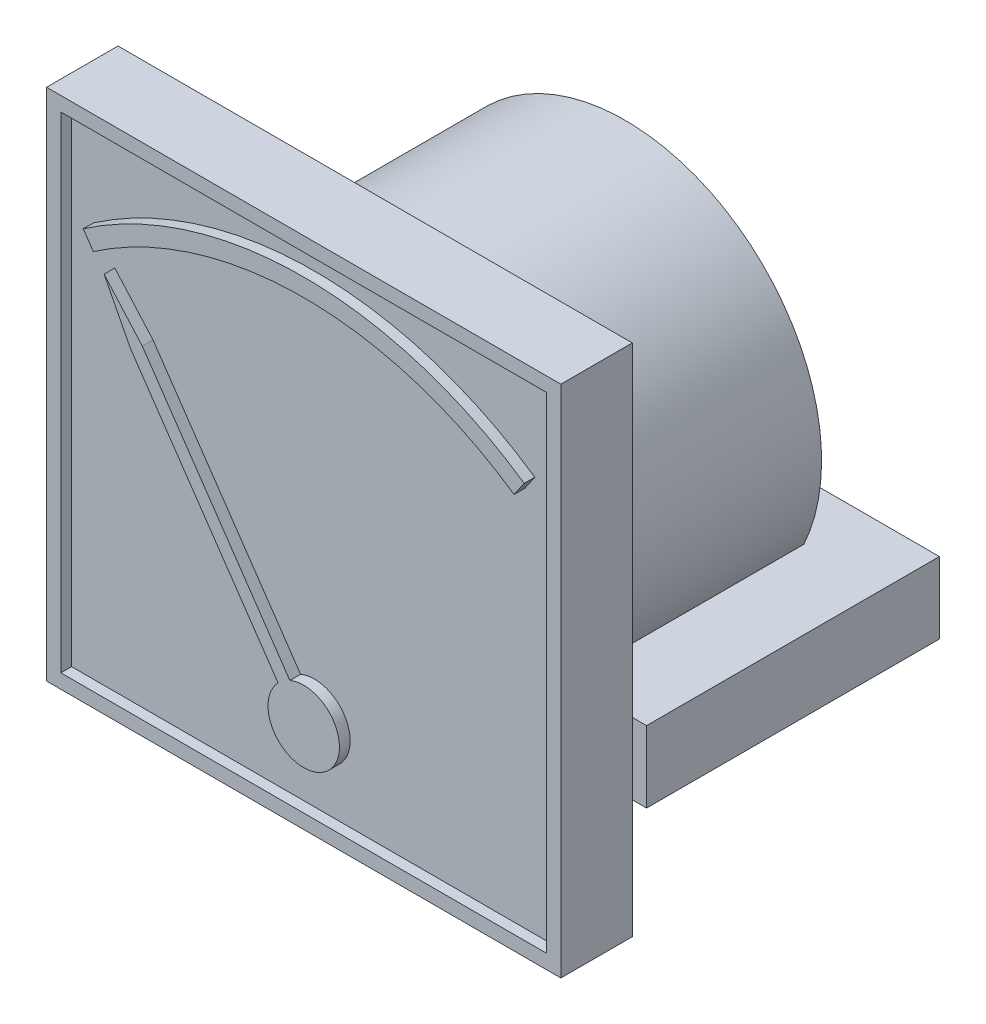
ISO-10303-21;
HEADER;
FILE_DESCRIPTION(('STEP AP214'),'2;1');
FILE_NAME('part.step','',(''),(''),'','','');
FILE_SCHEMA(('AUTOMOTIVE_DESIGN { 1 0 10303 214 1 1 1 1 }'));
ENDSEC;
DATA;
#1=APPLICATION_CONTEXT('core data for automotive mechanical design processes');
#2=APPLICATION_PROTOCOL_DEFINITION('international standard','automotive_design',2000,#1);
#3=PRODUCT_CONTEXT('',#1,'mechanical');
#4=PRODUCT('Part','Part','',(#3));
#5=PRODUCT_RELATED_PRODUCT_CATEGORY('part','',(#4));
#6=PRODUCT_DEFINITION_FORMATION('','',#4);
#7=PRODUCT_DEFINITION_CONTEXT('part definition',#1,'design');
#8=PRODUCT_DEFINITION('design','',#6,#7);
#9=PRODUCT_DEFINITION_SHAPE('','',#8);
#10=(LENGTH_UNIT() NAMED_UNIT(*) SI_UNIT(.MILLI.,.METRE.));
#11=(NAMED_UNIT(*) PLANE_ANGLE_UNIT() SI_UNIT($,.RADIAN.));
#12=(NAMED_UNIT(*) SI_UNIT($,.STERADIAN.) SOLID_ANGLE_UNIT());
#13=UNCERTAINTY_MEASURE_WITH_UNIT(LENGTH_MEASURE(1.E-05),#10,'distance_accuracy_value','');
#14=(GEOMETRIC_REPRESENTATION_CONTEXT(3) GLOBAL_UNCERTAINTY_ASSIGNED_CONTEXT((#13)) GLOBAL_UNIT_ASSIGNED_CONTEXT((#10,
#11,#12)) REPRESENTATION_CONTEXT('',''));
#15=CARTESIAN_POINT('',(0.,0.,0.));
#16=DIRECTION('',(0.,0.,1.));
#17=DIRECTION('',(1.,0.,0.));
#18=AXIS2_PLACEMENT_3D('',#15,#16,#17);
#19=CARTESIAN_POINT('',(36.,36.,-35.));
#20=DIRECTION('',(0.,0.,-1.));
#21=DIRECTION('',(-1.,0.,0.));
#22=AXIS2_PLACEMENT_3D('',#19,#20,#21);
#23=PLANE('',#22);
#24=DIRECTION('',(-1.,0.,0.));
#25=VECTOR('',#24,1.);
#26=CARTESIAN_POINT('',(36.,14.6,-35.));
#27=LINE('',#26,#25);
#28=CARTESIAN_POINT('',(53.2710740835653,14.6,-35.));
#29=VERTEX_POINT('',#28);
#30=CARTESIAN_POINT('',(18.7289259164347,14.6,-35.));
#31=VERTEX_POINT('',#30);
#32=EDGE_CURVE('E517',#29,#31,#27,.T.);
#33=ORIENTED_EDGE('',*,*,#32,.F.);
#34=CARTESIAN_POINT('',(36.,36.,-35.));
#35=DIRECTION('',(0.,0.,1.));
#36=DIRECTION('',(0.,1.,0.));
#37=AXIS2_PLACEMENT_3D('',#34,#35,#36);
#38=CIRCLE('',#37,27.5);
#39=CARTESIAN_POINT('',(37.5993228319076,8.54654545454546,-35.));
#40=VERTEX_POINT('',#39);
#41=EDGE_CURVE('E530',#40,#29,#38,.T.);
#42=ORIENTED_EDGE('',*,*,#41,.F.);
#43=CARTESIAN_POINT('',(36.,8.5,-35.));
#44=DIRECTION('',(0.,0.,1.));
#45=DIRECTION('',(0.,1.,0.));
#46=AXIS2_PLACEMENT_3D('',#43,#44,#45);
#47=CIRCLE('',#46,1.6);
#48=CARTESIAN_POINT('',(34.4006771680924,8.54654545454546,-35.));
#49=VERTEX_POINT('',#48);
#50=EDGE_CURVE('E521',#49,#40,#47,.T.);
#51=ORIENTED_EDGE('',*,*,#50,.F.);
#52=EDGE_CURVE('E529',#31,#49,#38,.T.);
#53=ORIENTED_EDGE('',*,*,#52,.F.);
#54=EDGE_LOOP('',(#33,#42,#51,#53));
#55=FACE_BOUND('',#54,.T.);
#56=ADVANCED_FACE('F14',(#55),#23,.T.);
#57=CARTESIAN_POINT('',(36.,36.,8.5));
#58=DIRECTION('',(0.,0.,-1.));
#59=DIRECTION('',(-1.,0.,0.));
#60=AXIS2_PLACEMENT_3D('',#57,#58,#59);
#61=PLANE('',#60);
#62=CARTESIAN_POINT('',(36.,12.5,8.5));
#63=DIRECTION('',(0.,0.,-1.));
#64=DIRECTION('',(-1.,0.,0.));
#65=AXIS2_PLACEMENT_3D('',#62,#63,#64);
#66=CIRCLE('',#65,54.472475);
#67=CARTESIAN_POINT('',(66.853549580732,57.392193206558,8.5));
#68=VERTEX_POINT('',#67);
#69=CARTESIAN_POINT('',(5.14645041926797,57.392193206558,8.5));
#70=VERTEX_POINT('',#69);
#71=EDGE_CURVE('E717',#68,#70,#66,.F.);
#72=ORIENTED_EDGE('',*,*,#71,.F.);
#73=DIRECTION('',(-0.566406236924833,-0.824126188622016,0.));
#74=VECTOR('',#73,1.);
#75=CARTESIAN_POINT('',(46.9695700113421,28.4608234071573,8.5));
#76=LINE('',#75,#74);
#77=CARTESIAN_POINT('',(65.4367693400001,55.3307651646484,8.5));
#78=VERTEX_POINT('',#77);
#79=EDGE_CURVE('E721',#68,#78,#76,.T.);
#80=ORIENTED_EDGE('',*,*,#79,.T.);
#81=CARTESIAN_POINT('',(36.,12.5,8.5));
#82=DIRECTION('',(0.,0.,-1.));
#83=DIRECTION('',(-1.,0.,0.));
#84=AXIS2_PLACEMENT_3D('',#81,#82,#83);
#85=CIRCLE('',#84,51.971125);
#86=CARTESIAN_POINT('',(6.5632306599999,55.3307651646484,8.5));
#87=VERTEX_POINT('',#86);
#88=EDGE_CURVE('E713',#87,#78,#85,.T.);
#89=ORIENTED_EDGE('',*,*,#88,.F.);
#90=DIRECTION('',(0.566406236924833,-0.824126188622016,0.));
#91=VECTOR('',#90,1.);
#92=CARTESIAN_POINT('',(25.0304299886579,28.4608234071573,8.5));
#93=LINE('',#92,#91);
#94=EDGE_CURVE('E709',#70,#87,#93,.T.);
#95=ORIENTED_EDGE('',*,*,#94,.F.);
#96=EDGE_LOOP('',(#72,#80,#89,#95));
#97=FACE_BOUND('',#96,.T.);
#98=DIRECTION('',(0.,1.,0.));
#99=VECTOR('',#98,1.);
#100=CARTESIAN_POINT('',(70.,36.,8.5));
#101=LINE('',#100,#99);
#102=CARTESIAN_POINT('',(70.,2.,8.5));
#103=VERTEX_POINT('',#102);
#104=CARTESIAN_POINT('',(70.,70.,8.5));
#105=VERTEX_POINT('',#104);
#106=EDGE_CURVE('E605',#103,#105,#101,.T.);
#107=ORIENTED_EDGE('',*,*,#106,.T.);
#108=DIRECTION('',(-1.,0.,0.));
#109=VECTOR('',#108,1.);
#110=CARTESIAN_POINT('',(36.,70.,8.5));
#111=LINE('',#110,#109);
#112=CARTESIAN_POINT('',(2.,70.,8.5));
#113=VERTEX_POINT('',#112);
#114=EDGE_CURVE('E610',#105,#113,#111,.T.);
#115=ORIENTED_EDGE('',*,*,#114,.T.);
#116=DIRECTION('',(0.,-1.,0.));
#117=VECTOR('',#116,1.);
#118=CARTESIAN_POINT('',(2.,36.,8.5));
#119=LINE('',#118,#117);
#120=CARTESIAN_POINT('',(2.,2.,8.5));
#121=VERTEX_POINT('',#120);
#122=EDGE_CURVE('E604',#113,#121,#119,.T.);
#123=ORIENTED_EDGE('',*,*,#122,.T.);
#124=DIRECTION('',(1.,0.,0.));
#125=VECTOR('',#124,1.);
#126=CARTESIAN_POINT('',(36.,2.,8.5));
#127=LINE('',#126,#125);
#128=EDGE_CURVE('E600',#121,#103,#127,.T.);
#129=ORIENTED_EDGE('',*,*,#128,.T.);
#130=EDGE_LOOP('',(#107,#115,#123,#129));
#131=FACE_BOUND('',#130,.T.);
#132=DIRECTION('',(-0.662578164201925,0.748992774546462,0.));
#133=VECTOR('',#132,1.);
#134=CARTESIAN_POINT('',(28.936592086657,29.7515287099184,8.5));
#135=LINE('',#134,#133);
#136=CARTESIAN_POINT('',(13.3964,47.3185,8.5));
#137=VERTEX_POINT('',#136);
#138=CARTESIAN_POINT('',(8.0545,53.3571,8.5));
#139=VERTEX_POINT('',#138);
#140=EDGE_CURVE('E706',#137,#139,#135,.T.);
#141=ORIENTED_EDGE('',*,*,#140,.F.);
#142=DIRECTION('',(-0.564554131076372,0.825396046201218,0.));
#143=VECTOR('',#142,1.);
#144=CARTESIAN_POINT('',(25.8748533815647,29.0746053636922,8.5));
#145=LINE('',#144,#143);
#146=CARTESIAN_POINT('',(34.0596625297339,17.1081547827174,8.5));
#147=VERTEX_POINT('',#146);
#148=EDGE_CURVE('E696',#147,#137,#145,.T.);
#149=ORIENTED_EDGE('',*,*,#148,.F.);
#150=CARTESIAN_POINT('',(36.,12.5,8.5));
#151=DIRECTION('',(0.,0.,-1.));
#152=DIRECTION('',(-1.,0.,0.));
#153=AXIS2_PLACEMENT_3D('',#150,#151,#152);
#154=CIRCLE('',#153,5.);
#155=CARTESIAN_POINT('',(32.4088677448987,15.9790471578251,8.5));
#156=VERTEX_POINT('',#155);
#157=EDGE_CURVE('E692',#147,#156,#154,.T.);
#158=ORIENTED_EDGE('',*,*,#157,.T.);
#159=DIRECTION('',(0.564555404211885,-0.825395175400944,0.));
#160=VECTOR('',#159,1.);
#161=CARTESIAN_POINT('',(24.2240537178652,27.9454652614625,8.5));
#162=LINE('',#161,#160);
#163=CARTESIAN_POINT('',(11.7456,46.1893,8.5));
#164=VERTEX_POINT('',#163);
#165=EDGE_CURVE('E699',#164,#156,#162,.T.);
#166=ORIENTED_EDGE('',*,*,#165,.F.);
#167=DIRECTION('',(0.457819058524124,-0.889045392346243,0.));
#168=VECTOR('',#167,1.);
#169=CARTESIAN_POINT('',(20.9765492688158,28.2635872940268,8.5));
#170=LINE('',#169,#168);
#171=EDGE_CURVE('E703',#139,#164,#170,.T.);
#172=ORIENTED_EDGE('',*,*,#171,.F.);
#173=EDGE_LOOP('',(#141,#149,#158,#166,#172));
#174=FACE_BOUND('',#173,.T.);
#175=ADVANCED_FACE('F832',(#97,#131,#174),#61,.F.);
#176=CARTESIAN_POINT('',(36.,36.,10.));
#177=DIRECTION('',(0.,0.,1.));
#178=DIRECTION('',(1.,0.,0.));
#179=AXIS2_PLACEMENT_3D('',#176,#177,#178);
#180=PLANE('',#179);
#181=DIRECTION('',(-1.,0.,0.));
#182=VECTOR('',#181,1.);
#183=CARTESIAN_POINT('',(36.,2.,10.));
#184=LINE('',#183,#182);
#185=CARTESIAN_POINT('',(70.,2.,10.));
#186=VERTEX_POINT('',#185);
#187=CARTESIAN_POINT('',(2.,2.,10.));
#188=VERTEX_POINT('',#187);
#189=EDGE_CURVE('E643',#186,#188,#184,.T.);
#190=ORIENTED_EDGE('',*,*,#189,.T.);
#191=DIRECTION('',(0.,1.,0.));
#192=VECTOR('',#191,1.);
#193=CARTESIAN_POINT('',(2.,36.,10.));
#194=LINE('',#193,#192);
#195=CARTESIAN_POINT('',(2.,70.,10.));
#196=VERTEX_POINT('',#195);
#197=EDGE_CURVE('E639',#188,#196,#194,.T.);
#198=ORIENTED_EDGE('',*,*,#197,.T.);
#199=DIRECTION('',(1.,0.,0.));
#200=VECTOR('',#199,1.);
#201=CARTESIAN_POINT('',(36.,70.,10.));
#202=LINE('',#201,#200);
#203=CARTESIAN_POINT('',(70.,70.,10.));
#204=VERTEX_POINT('',#203);
#205=EDGE_CURVE('E635',#196,#204,#202,.T.);
#206=ORIENTED_EDGE('',*,*,#205,.T.);
#207=DIRECTION('',(0.,-1.,0.));
#208=VECTOR('',#207,1.);
#209=CARTESIAN_POINT('',(70.,36.,10.));
#210=LINE('',#209,#208);
#211=EDGE_CURVE('E631',#204,#186,#210,.T.);
#212=ORIENTED_EDGE('',*,*,#211,.T.);
#213=EDGE_LOOP('',(#190,#198,#206,#212));
#214=FACE_BOUND('',#213,.T.);
#215=DIRECTION('',(-1.,0.,0.));
#216=VECTOR('',#215,1.);
#217=CARTESIAN_POINT('',(36.,0.,10.));
#218=LINE('',#217,#216);
#219=CARTESIAN_POINT('',(72.,0.,10.));
#220=VERTEX_POINT('',#219);
#221=CARTESIAN_POINT('',(0.,0.,10.));
#222=VERTEX_POINT('',#221);
#223=EDGE_CURVE('E689',#220,#222,#218,.T.);
#224=ORIENTED_EDGE('',*,*,#223,.F.);
#225=DIRECTION('',(0.,-1.,0.));
#226=VECTOR('',#225,1.);
#227=CARTESIAN_POINT('',(72.,36.,10.));
#228=LINE('',#227,#226);
#229=CARTESIAN_POINT('',(72.,72.,10.));
#230=VERTEX_POINT('',#229);
#231=EDGE_CURVE('E679',#230,#220,#228,.T.);
#232=ORIENTED_EDGE('',*,*,#231,.F.);
#233=DIRECTION('',(1.,0.,0.));
#234=VECTOR('',#233,1.);
#235=CARTESIAN_POINT('',(36.,72.,10.));
#236=LINE('',#235,#234);
#237=CARTESIAN_POINT('',(0.,72.,10.));
#238=VERTEX_POINT('',#237);
#239=EDGE_CURVE('E683',#238,#230,#236,.T.);
#240=ORIENTED_EDGE('',*,*,#239,.F.);
#241=DIRECTION('',(0.,1.,0.));
#242=VECTOR('',#241,1.);
#243=CARTESIAN_POINT('',(0.,36.,10.));
#244=LINE('',#243,#242);
#245=EDGE_CURVE('E686',#222,#238,#244,.T.);
#246=ORIENTED_EDGE('',*,*,#245,.F.);
#247=EDGE_LOOP('',(#224,#232,#240,#246));
#248=FACE_BOUND('',#247,.T.);
#249=ADVANCED_FACE('F16',(#214,#248),#180,.T.);
#250=CARTESIAN_POINT('',(36.,0.,0.));
#251=DIRECTION('',(0.,-1.,0.));
#252=DIRECTION('',(0.,0.,-1.));
#253=AXIS2_PLACEMENT_3D('',#250,#251,#252);
#254=PLANE('',#253);
#255=DIRECTION('',(0.,0.,1.));
#256=VECTOR('',#255,1.);
#257=CARTESIAN_POINT('',(72.,0.,0.));
#258=LINE('',#257,#256);
#259=CARTESIAN_POINT('',(72.,0.,0.));
#260=VERTEX_POINT('',#259);
#261=EDGE_CURVE('E656',#260,#220,#258,.T.);
#262=ORIENTED_EDGE('',*,*,#261,.T.);
#263=ORIENTED_EDGE('',*,*,#223,.T.);
#264=DIRECTION('',(0.,0.,1.));
#265=VECTOR('',#264,1.);
#266=CARTESIAN_POINT('',(0.,0.,0.));
#267=LINE('',#266,#265);
#268=CARTESIAN_POINT('',(0.,0.,0.));
#269=VERTEX_POINT('',#268);
#270=EDGE_CURVE('E675',#269,#222,#267,.T.);
#271=ORIENTED_EDGE('',*,*,#270,.F.);
#272=DIRECTION('',(1.,0.,0.));
#273=VECTOR('',#272,1.);
#274=CARTESIAN_POINT('',(36.,0.,0.));
#275=LINE('',#274,#273);
#276=EDGE_CURVE('E647',#269,#260,#275,.T.);
#277=ORIENTED_EDGE('',*,*,#276,.T.);
#278=EDGE_LOOP('',(#262,#263,#271,#277));
#279=FACE_BOUND('',#278,.T.);
#280=ADVANCED_FACE('F968',(#279),#254,.T.);
#281=CARTESIAN_POINT('',(0.,36.,0.));
#282=DIRECTION('',(-1.,0.,0.));
#283=DIRECTION('',(0.,0.,1.));
#284=AXIS2_PLACEMENT_3D('',#281,#282,#283);
#285=PLANE('',#284);
#286=ORIENTED_EDGE('',*,*,#270,.T.);
#287=ORIENTED_EDGE('',*,*,#245,.T.);
#288=DIRECTION('',(0.,0.,1.));
#289=VECTOR('',#288,1.);
#290=CARTESIAN_POINT('',(0.,72.,0.));
#291=LINE('',#290,#289);
#292=CARTESIAN_POINT('',(0.,72.,0.));
#293=VERTEX_POINT('',#292);
#294=EDGE_CURVE('E671',#293,#238,#291,.T.);
#295=ORIENTED_EDGE('',*,*,#294,.F.);
#296=DIRECTION('',(0.,-1.,0.));
#297=VECTOR('',#296,1.);
#298=CARTESIAN_POINT('',(0.,36.,0.));
#299=LINE('',#298,#297);
#300=EDGE_CURVE('E651',#293,#269,#299,.T.);
#301=ORIENTED_EDGE('',*,*,#300,.T.);
#302=EDGE_LOOP('',(#286,#287,#295,#301));
#303=FACE_BOUND('',#302,.T.);
#304=ADVANCED_FACE('F985',(#303),#285,.T.);
#305=CARTESIAN_POINT('',(36.,72.,0.));
#306=DIRECTION('',(0.,1.,0.));
#307=DIRECTION('',(0.,0.,1.));
#308=AXIS2_PLACEMENT_3D('',#305,#306,#307);
#309=PLANE('',#308);
#310=ORIENTED_EDGE('',*,*,#294,.T.);
#311=ORIENTED_EDGE('',*,*,#239,.T.);
#312=DIRECTION('',(0.,0.,1.));
#313=VECTOR('',#312,1.);
#314=CARTESIAN_POINT('',(72.,72.,0.));
#315=LINE('',#314,#313);
#316=CARTESIAN_POINT('',(72.,72.,0.));
#317=VERTEX_POINT('',#316);
#318=EDGE_CURVE('E667',#317,#230,#315,.T.);
#319=ORIENTED_EDGE('',*,*,#318,.F.);
#320=DIRECTION('',(-1.,0.,0.));
#321=VECTOR('',#320,1.);
#322=CARTESIAN_POINT('',(36.,72.,0.));
#323=LINE('',#322,#321);
#324=EDGE_CURVE('E657',#317,#293,#323,.T.);
#325=ORIENTED_EDGE('',*,*,#324,.T.);
#326=EDGE_LOOP('',(#310,#311,#319,#325));
#327=FACE_BOUND('',#326,.T.);
#328=ADVANCED_FACE('F997',(#327),#309,.T.);
#329=CARTESIAN_POINT('',(36.,36.,0.));
#330=DIRECTION('',(0.,0.,-1.));
#331=DIRECTION('',(-1.,0.,0.));
#332=AXIS2_PLACEMENT_3D('',#329,#330,#331);
#333=PLANE('',#332);
#334=CARTESIAN_POINT('',(36.,8.5,0.));
#335=DIRECTION('',(0.,0.,-1.));
#336=DIRECTION('',(0.,1.,0.));
#337=AXIS2_PLACEMENT_3D('',#334,#335,#336);
#338=CIRCLE('',#337,1.6);
#339=CARTESIAN_POINT('',(37.5993228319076,8.54654545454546,0.));
#340=VERTEX_POINT('',#339);
#341=CARTESIAN_POINT('',(34.4006771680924,8.54654545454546,0.));
#342=VERTEX_POINT('',#341);
#343=EDGE_CURVE('E525',#340,#342,#338,.T.);
#344=ORIENTED_EDGE('',*,*,#343,.F.);
#345=CARTESIAN_POINT('',(36.,36.,0.));
#346=DIRECTION('',(0.,0.,-1.));
#347=DIRECTION('',(-1.,0.,0.));
#348=AXIS2_PLACEMENT_3D('',#345,#346,#347);
#349=CIRCLE('',#348,27.5);
#350=EDGE_CURVE('E724',#342,#340,#349,.T.);
#351=ORIENTED_EDGE('',*,*,#350,.F.);
#352=EDGE_LOOP('',(#344,#351));
#353=FACE_BOUND('',#352,.T.);
#354=DIRECTION('',(0.,1.,0.));
#355=VECTOR('',#354,1.);
#356=CARTESIAN_POINT('',(72.,36.,0.));
#357=LINE('',#356,#355);
#358=EDGE_CURVE('E652',#260,#317,#357,.T.);
#359=ORIENTED_EDGE('',*,*,#358,.F.);
#360=ORIENTED_EDGE('',*,*,#276,.F.);
#361=ORIENTED_EDGE('',*,*,#300,.F.);
#362=ORIENTED_EDGE('',*,*,#324,.F.);
#363=EDGE_LOOP('',(#359,#360,#361,#362));
#364=FACE_BOUND('',#363,.T.);
#365=ADVANCED_FACE('F1009',(#353,#364),#333,.T.);
#366=CARTESIAN_POINT('',(72.,36.,0.));
#367=DIRECTION('',(1.,0.,0.));
#368=DIRECTION('',(0.,0.,-1.));
#369=AXIS2_PLACEMENT_3D('',#366,#367,#368);
#370=PLANE('',#369);
#371=ORIENTED_EDGE('',*,*,#358,.T.);
#372=ORIENTED_EDGE('',*,*,#318,.T.);
#373=ORIENTED_EDGE('',*,*,#231,.T.);
#374=ORIENTED_EDGE('',*,*,#261,.F.);
#375=EDGE_LOOP('',(#371,#372,#373,#374));
#376=FACE_BOUND('',#375,.T.);
#377=ADVANCED_FACE('F1022',(#376),#370,.T.);
#378=CARTESIAN_POINT('',(36.,2.,8.5));
#379=DIRECTION('',(0.,-1.,0.));
#380=DIRECTION('',(0.,0.,-1.));
#381=AXIS2_PLACEMENT_3D('',#378,#379,#380);
#382=PLANE('',#381);
#383=DIRECTION('',(0.,0.,1.));
#384=VECTOR('',#383,1.);
#385=CARTESIAN_POINT('',(70.,2.,8.5));
#386=LINE('',#385,#384);
#387=EDGE_CURVE('E609',#103,#186,#386,.T.);
#388=ORIENTED_EDGE('',*,*,#387,.F.);
#389=ORIENTED_EDGE('',*,*,#128,.F.);
#390=DIRECTION('',(0.,0.,1.));
#391=VECTOR('',#390,1.);
#392=CARTESIAN_POINT('',(2.,2.,8.5));
#393=LINE('',#392,#391);
#394=EDGE_CURVE('E627',#121,#188,#393,.T.);
#395=ORIENTED_EDGE('',*,*,#394,.T.);
#396=ORIENTED_EDGE('',*,*,#189,.F.);
#397=EDGE_LOOP('',(#388,#389,#395,#396));
#398=FACE_BOUND('',#397,.T.);
#399=ADVANCED_FACE('F1027',(#398),#382,.F.);
#400=CARTESIAN_POINT('',(2.,36.,8.5));
#401=DIRECTION('',(-1.,0.,0.));
#402=DIRECTION('',(0.,0.,1.));
#403=AXIS2_PLACEMENT_3D('',#400,#401,#402);
#404=PLANE('',#403);
#405=ORIENTED_EDGE('',*,*,#394,.F.);
#406=ORIENTED_EDGE('',*,*,#122,.F.);
#407=DIRECTION('',(0.,0.,1.));
#408=VECTOR('',#407,1.);
#409=CARTESIAN_POINT('',(2.,70.,8.5));
#410=LINE('',#409,#408);
#411=EDGE_CURVE('E623',#113,#196,#410,.T.);
#412=ORIENTED_EDGE('',*,*,#411,.T.);
#413=ORIENTED_EDGE('',*,*,#197,.F.);
#414=EDGE_LOOP('',(#405,#406,#412,#413));
#415=FACE_BOUND('',#414,.T.);
#416=ADVANCED_FACE('F1036',(#415),#404,.F.);
#417=CARTESIAN_POINT('',(36.,70.,8.5));
#418=DIRECTION('',(0.,1.,0.));
#419=DIRECTION('',(0.,0.,1.));
#420=AXIS2_PLACEMENT_3D('',#417,#418,#419);
#421=PLANE('',#420);
#422=ORIENTED_EDGE('',*,*,#411,.F.);
#423=ORIENTED_EDGE('',*,*,#114,.F.);
#424=DIRECTION('',(0.,0.,1.));
#425=VECTOR('',#424,1.);
#426=CARTESIAN_POINT('',(70.,70.,8.5));
#427=LINE('',#426,#425);
#428=EDGE_CURVE('E619',#105,#204,#427,.T.);
#429=ORIENTED_EDGE('',*,*,#428,.T.);
#430=ORIENTED_EDGE('',*,*,#205,.F.);
#431=EDGE_LOOP('',(#422,#423,#429,#430));
#432=FACE_BOUND('',#431,.T.);
#433=ADVANCED_FACE('F1048',(#432),#421,.F.);
#434=CARTESIAN_POINT('',(70.,36.,8.5));
#435=DIRECTION('',(1.,0.,0.));
#436=DIRECTION('',(0.,0.,-1.));
#437=AXIS2_PLACEMENT_3D('',#434,#435,#436);
#438=PLANE('',#437);
#439=ORIENTED_EDGE('',*,*,#106,.F.);
#440=ORIENTED_EDGE('',*,*,#387,.T.);
#441=ORIENTED_EDGE('',*,*,#211,.F.);
#442=ORIENTED_EDGE('',*,*,#428,.F.);
#443=EDGE_LOOP('',(#439,#440,#441,#442));
#444=FACE_BOUND('',#443,.T.);
#445=ADVANCED_FACE('F1059',(#444),#438,.F.);
#446=CARTESIAN_POINT('',(11.7456,46.1893,10.));
#447=DIRECTION('',(0.825395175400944,0.564555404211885,0.));
#448=DIRECTION('',(-0.564555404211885,0.825395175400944,0.));
#449=AXIS2_PLACEMENT_3D('',#446,#447,#448);
#450=PLANE('',#449);
#451=DIRECTION('',(0.,0.,-1.));
#452=VECTOR('',#451,1.);
#453=CARTESIAN_POINT('',(11.7456,46.1893,10.));
#454=LINE('',#453,#452);
#455=CARTESIAN_POINT('',(11.7456,46.1893,10.));
#456=VERTEX_POINT('',#455);
#457=EDGE_CURVE('E585',#456,#164,#454,.T.);
#458=ORIENTED_EDGE('',*,*,#457,.T.);
#459=ORIENTED_EDGE('',*,*,#165,.T.);
#460=DIRECTION('',(0.,0.,-1.));
#461=VECTOR('',#460,1.);
#462=CARTESIAN_POINT('',(32.4088677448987,15.9790471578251,10.));
#463=LINE('',#462,#461);
#464=CARTESIAN_POINT('',(32.4088677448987,15.9790471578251,10.));
#465=VERTEX_POINT('',#464);
#466=EDGE_CURVE('E572',#156,#465,#463,.F.);
#467=ORIENTED_EDGE('',*,*,#466,.T.);
#468=DIRECTION('',(0.564555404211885,-0.825395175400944,0.));
#469=VECTOR('',#468,1.);
#470=CARTESIAN_POINT('',(11.7456,46.1893,10.));
#471=LINE('',#470,#469);
#472=EDGE_CURVE('E575',#456,#465,#471,.T.);
#473=ORIENTED_EDGE('',*,*,#472,.F.);
#474=EDGE_LOOP('',(#458,#459,#467,#473));
#475=FACE_BOUND('',#474,.T.);
#476=ADVANCED_FACE('F1071',(#475),#450,.F.);
#477=CARTESIAN_POINT('',(34.0597,17.1081,10.));
#478=DIRECTION('',(-0.825396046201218,-0.564554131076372,0.));
#479=DIRECTION('',(0.564554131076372,-0.825396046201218,0.));
#480=AXIS2_PLACEMENT_3D('',#477,#478,#479);
#481=PLANE('',#480);
#482=DIRECTION('',(0.,0.,-1.));
#483=VECTOR('',#482,1.);
#484=CARTESIAN_POINT('',(34.0596625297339,17.1081547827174,10.));
#485=LINE('',#484,#483);
#486=CARTESIAN_POINT('',(34.0596625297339,17.1081547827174,10.));
#487=VERTEX_POINT('',#486);
#488=EDGE_CURVE('E568',#487,#147,#485,.T.);
#489=ORIENTED_EDGE('',*,*,#488,.T.);
#490=ORIENTED_EDGE('',*,*,#148,.T.);
#491=DIRECTION('',(0.,0.,-1.));
#492=VECTOR('',#491,1.);
#493=CARTESIAN_POINT('',(13.3964,47.3185,10.));
#494=LINE('',#493,#492);
#495=CARTESIAN_POINT('',(13.3964,47.3185,10.));
#496=VERTEX_POINT('',#495);
#497=EDGE_CURVE('E596',#496,#137,#494,.T.);
#498=ORIENTED_EDGE('',*,*,#497,.F.);
#499=DIRECTION('',(-0.564554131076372,0.825396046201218,0.));
#500=VECTOR('',#499,1.);
#501=CARTESIAN_POINT('',(34.0597,17.1081,10.));
#502=LINE('',#501,#500);
#503=EDGE_CURVE('E576',#487,#496,#502,.T.);
#504=ORIENTED_EDGE('',*,*,#503,.F.);
#505=EDGE_LOOP('',(#489,#490,#498,#504));
#506=FACE_BOUND('',#505,.T.);
#507=ADVANCED_FACE('F1080',(#506),#481,.F.);
#508=CARTESIAN_POINT('',(13.3964,47.3185,10.));
#509=DIRECTION('',(-0.748992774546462,-0.662578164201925,0.));
#510=DIRECTION('',(0.662578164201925,-0.748992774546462,0.));
#511=AXIS2_PLACEMENT_3D('',#508,#509,#510);
#512=PLANE('',#511);
#513=ORIENTED_EDGE('',*,*,#497,.T.);
#514=ORIENTED_EDGE('',*,*,#140,.T.);
#515=DIRECTION('',(0.,0.,-1.));
#516=VECTOR('',#515,1.);
#517=CARTESIAN_POINT('',(8.0545,53.3571,10.));
#518=LINE('',#517,#516);
#519=CARTESIAN_POINT('',(8.0545,53.3571,10.));
#520=VERTEX_POINT('',#519);
#521=EDGE_CURVE('E592',#520,#139,#518,.T.);
#522=ORIENTED_EDGE('',*,*,#521,.F.);
#523=DIRECTION('',(-0.662578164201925,0.748992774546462,0.));
#524=VECTOR('',#523,1.);
#525=CARTESIAN_POINT('',(13.3964,47.3185,10.));
#526=LINE('',#525,#524);
#527=EDGE_CURVE('E579',#496,#520,#526,.T.);
#528=ORIENTED_EDGE('',*,*,#527,.F.);
#529=EDGE_LOOP('',(#513,#514,#522,#528));
#530=FACE_BOUND('',#529,.T.);
#531=ADVANCED_FACE('F1093',(#530),#512,.F.);
#532=CARTESIAN_POINT('',(8.0545,53.3571,10.));
#533=DIRECTION('',(0.889045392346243,0.457819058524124,0.));
#534=DIRECTION('',(-0.457819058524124,0.889045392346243,0.));
#535=AXIS2_PLACEMENT_3D('',#532,#533,#534);
#536=PLANE('',#535);
#537=ORIENTED_EDGE('',*,*,#521,.T.);
#538=ORIENTED_EDGE('',*,*,#171,.T.);
#539=ORIENTED_EDGE('',*,*,#457,.F.);
#540=DIRECTION('',(0.457819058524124,-0.889045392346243,0.));
#541=VECTOR('',#540,1.);
#542=CARTESIAN_POINT('',(8.0545,53.3571,10.));
#543=LINE('',#542,#541);
#544=EDGE_CURVE('E582',#520,#456,#543,.T.);
#545=ORIENTED_EDGE('',*,*,#544,.F.);
#546=EDGE_LOOP('',(#537,#538,#539,#545));
#547=FACE_BOUND('',#546,.T.);
#548=ADVANCED_FACE('F1106',(#547),#536,.F.);
#549=CARTESIAN_POINT('',(36.,12.5,10.));
#550=DIRECTION('',(0.,0.,-1.));
#551=DIRECTION('',(0.,-1.,0.));
#552=AXIS2_PLACEMENT_3D('',#549,#550,#551);
#553=CYLINDRICAL_SURFACE('',#552,5.);
#554=ORIENTED_EDGE('',*,*,#157,.F.);
#555=ORIENTED_EDGE('',*,*,#488,.F.);
#556=CARTESIAN_POINT('',(36.,12.5,10.));
#557=DIRECTION('',(0.,0.,-1.));
#558=DIRECTION('',(0.,-1.,0.));
#559=AXIS2_PLACEMENT_3D('',#556,#557,#558);
#560=CIRCLE('',#559,5.);
#561=EDGE_CURVE('E564',#487,#465,#560,.T.);
#562=ORIENTED_EDGE('',*,*,#561,.T.);
#563=ORIENTED_EDGE('',*,*,#466,.F.);
#564=EDGE_LOOP('',(#554,#555,#562,#563));
#565=FACE_BOUND('',#564,.T.);
#566=ADVANCED_FACE('F1118',(#565),#553,.T.);
#567=CARTESIAN_POINT('',(32.4089,15.979,10.));
#568=DIRECTION('',(0.,0.,1.));
#569=DIRECTION('',(1.,0.,0.));
#570=AXIS2_PLACEMENT_3D('',#567,#568,#569);
#571=PLANE('',#570);
#572=ORIENTED_EDGE('',*,*,#472,.T.);
#573=ORIENTED_EDGE('',*,*,#561,.F.);
#574=ORIENTED_EDGE('',*,*,#503,.T.);
#575=ORIENTED_EDGE('',*,*,#527,.T.);
#576=ORIENTED_EDGE('',*,*,#544,.T.);
#577=EDGE_LOOP('',(#572,#573,#574,#575,#576));
#578=FACE_BOUND('',#577,.T.);
#579=ADVANCED_FACE('F1129',(#578),#571,.T.);
#580=CARTESIAN_POINT('',(36.,12.5,8.));
#581=DIRECTION('',(0.,0.,1.));
#582=DIRECTION('',(0.824126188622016,0.566406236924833,0.));
#583=AXIS2_PLACEMENT_3D('',#580,#581,#582);
#584=CONICAL_SURFACE('',#583,54.4633,0.0183479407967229);
#585=DIRECTION('',(0.0103918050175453,0.015120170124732,0.999831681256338));
#586=VECTOR('',#585,1.);
#587=CARTESIAN_POINT('',(66.8483528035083,57.3846318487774,8.));
#588=LINE('',#587,#586);
#589=CARTESIAN_POINT('',(66.8691399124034,57.4148772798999,10.));
#590=VERTEX_POINT('',#589);
#591=EDGE_CURVE('E544',#68,#590,#588,.T.);
#592=ORIENTED_EDGE('',*,*,#591,.F.);
#593=ORIENTED_EDGE('',*,*,#71,.T.);
#594=DIRECTION('',(-0.0103918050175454,0.015120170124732,0.999831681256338));
#595=VECTOR('',#594,1.);
#596=CARTESIAN_POINT('',(5.15164719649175,57.3846318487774,8.));
#597=LINE('',#596,#595);
#598=CARTESIAN_POINT('',(5.13086008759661,57.4148772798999,10.));
#599=VERTEX_POINT('',#598);
#600=EDGE_CURVE('E534',#70,#599,#597,.T.);
#601=ORIENTED_EDGE('',*,*,#600,.T.);
#602=CARTESIAN_POINT('',(36.,12.5,10.));
#603=DIRECTION('',(0.,0.,1.));
#604=DIRECTION('',(0.824126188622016,0.566406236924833,0.));
#605=AXIS2_PLACEMENT_3D('',#602,#603,#604);
#606=CIRCLE('',#605,54.5);
#607=EDGE_CURVE('E560',#590,#599,#606,.T.);
#608=ORIENTED_EDGE('',*,*,#607,.F.);
#609=EDGE_LOOP('',(#592,#593,#601,#608));
#610=FACE_BOUND('',#609,.T.);
#611=ADVANCED_FACE('F1141',(#610),#584,.T.);
#612=CARTESIAN_POINT('',(36.,12.5,10.));
#613=DIRECTION('',(0.,0.,1.));
#614=DIRECTION('',(0.824126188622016,0.566406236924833,0.));
#615=AXIS2_PLACEMENT_3D('',#612,#613,#614);
#616=CONICAL_SURFACE('',#615,52.,0.0192476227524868);
#617=DIRECTION('',(0.0109013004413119,-0.0158614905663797,-0.999814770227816));
#618=VECTOR('',#617,1.);
#619=CARTESIAN_POINT('',(6.5468756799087,55.3545618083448,10.));
#620=LINE('',#619,#618);
#621=CARTESIAN_POINT('',(6.5468756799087,55.3545618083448,10.));
#622=VERTEX_POINT('',#621);
#623=EDGE_CURVE('E540',#622,#87,#620,.T.);
#624=ORIENTED_EDGE('',*,*,#623,.T.);
#625=ORIENTED_EDGE('',*,*,#88,.T.);
#626=DIRECTION('',(-0.0109013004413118,-0.0158614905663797,-0.999814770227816));
#627=VECTOR('',#626,1.);
#628=CARTESIAN_POINT('',(65.4531243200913,55.3545618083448,10.));
#629=LINE('',#628,#627);
#630=CARTESIAN_POINT('',(65.4531243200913,55.3545618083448,10.));
#631=VERTEX_POINT('',#630);
#632=EDGE_CURVE('E551',#631,#78,#629,.T.);
#633=ORIENTED_EDGE('',*,*,#632,.F.);
#634=CARTESIAN_POINT('',(36.,12.5,10.));
#635=DIRECTION('',(0.,0.,1.));
#636=DIRECTION('',(0.824126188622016,0.566406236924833,0.));
#637=AXIS2_PLACEMENT_3D('',#634,#635,#636);
#638=CIRCLE('',#637,52.);
#639=EDGE_CURVE('E555',#631,#622,#638,.T.);
#640=ORIENTED_EDGE('',*,*,#639,.T.);
#641=EDGE_LOOP('',(#624,#625,#633,#640));
#642=FACE_BOUND('',#641,.T.);
#643=ADVANCED_FACE('F1150',(#642),#616,.F.);
#644=CARTESIAN_POINT('',(66.8691399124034,57.4148772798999,10.));
#645=DIRECTION('',(0.824126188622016,-0.566406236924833,0.));
#646=DIRECTION('',(0.,0.,-1.));
#647=AXIS2_PLACEMENT_3D('',#644,#645,#646);
#648=PLANE('',#647);
#649=ORIENTED_EDGE('',*,*,#79,.F.);
#650=ORIENTED_EDGE('',*,*,#591,.T.);
#651=DIRECTION('',(-0.566406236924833,-0.824126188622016,0.));
#652=VECTOR('',#651,1.);
#653=CARTESIAN_POINT('',(66.8691399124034,57.4148772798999,10.));
#654=LINE('',#653,#652);
#655=EDGE_CURVE('E547',#590,#631,#654,.T.);
#656=ORIENTED_EDGE('',*,*,#655,.T.);
#657=ORIENTED_EDGE('',*,*,#632,.T.);
#658=EDGE_LOOP('',(#649,#650,#656,#657));
#659=FACE_BOUND('',#658,.T.);
#660=ADVANCED_FACE('F1163',(#659),#648,.T.);
#661=CARTESIAN_POINT('',(5.13086008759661,57.4148772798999,10.));
#662=DIRECTION('',(0.824126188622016,0.566406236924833,0.));
#663=DIRECTION('',(0.,0.,-1.));
#664=AXIS2_PLACEMENT_3D('',#661,#662,#663);
#665=PLANE('',#664);
#666=ORIENTED_EDGE('',*,*,#600,.F.);
#667=ORIENTED_EDGE('',*,*,#94,.T.);
#668=ORIENTED_EDGE('',*,*,#623,.F.);
#669=DIRECTION('',(0.566406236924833,-0.824126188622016,0.));
#670=VECTOR('',#669,1.);
#671=CARTESIAN_POINT('',(5.13086008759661,57.4148772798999,10.));
#672=LINE('',#671,#670);
#673=EDGE_CURVE('E536',#599,#622,#672,.T.);
#674=ORIENTED_EDGE('',*,*,#673,.F.);
#675=EDGE_LOOP('',(#666,#667,#668,#674));
#676=FACE_BOUND('',#675,.T.);
#677=ADVANCED_FACE('F1176',(#676),#665,.F.);
#678=CARTESIAN_POINT('',(66.8691399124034,57.4148772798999,10.));
#679=DIRECTION('',(0.,0.,-1.));
#680=DIRECTION('',(-0.824126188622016,-0.566406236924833,0.));
#681=AXIS2_PLACEMENT_3D('',#678,#679,#680);
#682=PLANE('',#681);
#683=ORIENTED_EDGE('',*,*,#639,.F.);
#684=ORIENTED_EDGE('',*,*,#655,.F.);
#685=ORIENTED_EDGE('',*,*,#607,.T.);
#686=ORIENTED_EDGE('',*,*,#673,.T.);
#687=EDGE_LOOP('',(#683,#684,#685,#686));
#688=FACE_BOUND('',#687,.T.);
#689=ADVANCED_FACE('F846',(#688),#682,.F.);
#690=DIRECTION('',(-1.,0.,0.));
#691=VECTOR('',#690,1.);
#692=CARTESIAN_POINT('',(36.,32.5,-35.));
#693=LINE('',#692,#691);
#694=CARTESIAN_POINT('',(49.5,32.5,-35.));
#695=VERTEX_POINT('',#694);
#696=CARTESIAN_POINT('',(42.5,32.5,-35.));
#697=VERTEX_POINT('',#696);
#698=EDGE_CURVE('E9',#695,#697,#693,.T.);
#699=ORIENTED_EDGE('',*,*,#698,.F.);
#700=DIRECTION('',(0.,-1.,0.));
#701=VECTOR('',#700,1.);
#702=CARTESIAN_POINT('',(49.5,36.,-35.));
#703=LINE('',#702,#701);
#704=CARTESIAN_POINT('',(49.5,39.5,-35.));
#705=VERTEX_POINT('',#704);
#706=EDGE_CURVE('E295',#705,#695,#703,.T.);
#707=ORIENTED_EDGE('',*,*,#706,.F.);
#708=DIRECTION('',(1.,0.,0.));
#709=VECTOR('',#708,1.);
#710=CARTESIAN_POINT('',(36.,39.5,-35.));
#711=LINE('',#710,#709);
#712=CARTESIAN_POINT('',(42.5,39.5,-35.));
#713=VERTEX_POINT('',#712);
#714=EDGE_CURVE('E35',#713,#705,#711,.T.);
#715=ORIENTED_EDGE('',*,*,#714,.F.);
#716=DIRECTION('',(0.,1.,0.));
#717=VECTOR('',#716,1.);
#718=CARTESIAN_POINT('',(42.5,36.,-35.));
#719=LINE('',#718,#717);
#720=EDGE_CURVE('E24',#697,#713,#719,.T.);
#721=ORIENTED_EDGE('',*,*,#720,.F.);
#722=EDGE_LOOP('',(#699,#707,#715,#721));
#723=FACE_BOUND('',#722,.T.);
#724=DIRECTION('',(-1.,0.,0.));
#725=VECTOR('',#724,1.);
#726=CARTESIAN_POINT('',(36.,32.5,-35.));
#727=LINE('',#726,#725);
#728=CARTESIAN_POINT('',(29.5,32.5,-35.));
#729=VERTEX_POINT('',#728);
#730=CARTESIAN_POINT('',(22.5,32.5,-35.));
#731=VERTEX_POINT('',#730);
#732=EDGE_CURVE('E777',#729,#731,#727,.T.);
#733=ORIENTED_EDGE('',*,*,#732,.F.);
#734=DIRECTION('',(0.,-1.,0.));
#735=VECTOR('',#734,1.);
#736=CARTESIAN_POINT('',(29.5,36.,-35.));
#737=LINE('',#736,#735);
#738=CARTESIAN_POINT('',(29.5,39.5,-35.));
#739=VERTEX_POINT('',#738);
#740=EDGE_CURVE('E765',#739,#729,#737,.T.);
#741=ORIENTED_EDGE('',*,*,#740,.F.);
#742=DIRECTION('',(1.,0.,0.));
#743=VECTOR('',#742,1.);
#744=CARTESIAN_POINT('',(36.,39.5,-35.));
#745=LINE('',#744,#743);
#746=CARTESIAN_POINT('',(22.5,39.5,-35.));
#747=VERTEX_POINT('',#746);
#748=EDGE_CURVE('E769',#747,#739,#745,.T.);
#749=ORIENTED_EDGE('',*,*,#748,.F.);
#750=DIRECTION('',(0.,1.,0.));
#751=VECTOR('',#750,1.);
#752=CARTESIAN_POINT('',(22.5,36.,-35.));
#753=LINE('',#752,#751);
#754=EDGE_CURVE('E773',#731,#747,#753,.T.);
#755=ORIENTED_EDGE('',*,*,#754,.F.);
#756=EDGE_LOOP('',(#733,#741,#749,#755));
#757=FACE_BOUND('',#756,.T.);
#758=DIRECTION('',(1.,0.,0.));
#759=VECTOR('',#758,1.);
#760=CARTESIAN_POINT('',(36.,24.6,-35.));
#761=LINE('',#760,#759);
#762=CARTESIAN_POINT('',(10.9742132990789,24.6,-35.));
#763=VERTEX_POINT('',#762);
#764=CARTESIAN_POINT('',(61.0257867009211,24.6,-35.));
#765=VERTEX_POINT('',#764);
#766=EDGE_CURVE('E513',#763,#765,#761,.T.);
#767=ORIENTED_EDGE('',*,*,#766,.F.);
#768=EDGE_CURVE('E535',#765,#763,#38,.T.);
#769=ORIENTED_EDGE('',*,*,#768,.F.);
#770=EDGE_LOOP('',(#767,#769));
#771=FACE_BOUND('',#770,.T.);
#772=ADVANCED_FACE('F835',(#723,#757,#771),#23,.T.);
#773=CARTESIAN_POINT('',(36.,36.,-35.));
#774=DIRECTION('',(0.,0.,1.));
#775=DIRECTION('',(0.,1.,0.));
#776=AXIS2_PLACEMENT_3D('',#773,#774,#775);
#777=CYLINDRICAL_SURFACE('',#776,27.5);
#778=DIRECTION('',(0.,0.,1.));
#779=VECTOR('',#778,1.);
#780=CARTESIAN_POINT('',(18.7289259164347,14.6,-35.));
#781=LINE('',#780,#779);
#782=CARTESIAN_POINT('',(18.7289259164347,14.6,-2.));
#783=VERTEX_POINT('',#782);
#784=EDGE_CURVE('E753',#31,#783,#781,.T.);
#785=ORIENTED_EDGE('',*,*,#784,.F.);
#786=ORIENTED_EDGE('',*,*,#52,.T.);
#787=DIRECTION('',(0.,0.,1.));
#788=VECTOR('',#787,1.);
#789=CARTESIAN_POINT('',(34.4006771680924,8.54654545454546,-17.5));
#790=LINE('',#789,#788);
#791=EDGE_CURVE('E728',#342,#49,#790,.F.);
#792=ORIENTED_EDGE('',*,*,#791,.F.);
#793=ORIENTED_EDGE('',*,*,#350,.T.);
#794=DIRECTION('',(0.,0.,1.));
#795=VECTOR('',#794,1.);
#796=CARTESIAN_POINT('',(37.5993228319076,8.54654545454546,-17.5));
#797=LINE('',#796,#795);
#798=EDGE_CURVE('E732',#40,#340,#797,.T.);
#799=ORIENTED_EDGE('',*,*,#798,.F.);
#800=ORIENTED_EDGE('',*,*,#41,.T.);
#801=DIRECTION('',(0.,0.,1.));
#802=VECTOR('',#801,1.);
#803=CARTESIAN_POINT('',(53.2710740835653,14.6,-35.));
#804=LINE('',#803,#802);
#805=CARTESIAN_POINT('',(53.2710740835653,14.6,-2.));
#806=VERTEX_POINT('',#805);
#807=EDGE_CURVE('E744',#806,#29,#804,.F.);
#808=ORIENTED_EDGE('',*,*,#807,.F.);
#809=CARTESIAN_POINT('',(36.,36.,-2.));
#810=DIRECTION('',(0.,0.,1.));
#811=DIRECTION('',(1.,0.,0.));
#812=AXIS2_PLACEMENT_3D('',#809,#810,#811);
#813=CIRCLE('',#812,27.5);
#814=CARTESIAN_POINT('',(61.0257867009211,24.6,-2.));
#815=VERTEX_POINT('',#814);
#816=EDGE_CURVE('E740',#815,#806,#813,.F.);
#817=ORIENTED_EDGE('',*,*,#816,.F.);
#818=DIRECTION('',(0.,0.,1.));
#819=VECTOR('',#818,1.);
#820=CARTESIAN_POINT('',(61.0257867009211,24.6,-35.));
#821=LINE('',#820,#819);
#822=EDGE_CURVE('E736',#765,#815,#821,.T.);
#823=ORIENTED_EDGE('',*,*,#822,.F.);
#824=ORIENTED_EDGE('',*,*,#768,.T.);
#825=DIRECTION('',(0.,0.,1.));
#826=VECTOR('',#825,1.);
#827=CARTESIAN_POINT('',(10.9742132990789,24.6,-35.));
#828=LINE('',#827,#826);
#829=CARTESIAN_POINT('',(10.9742132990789,24.6,-2.));
#830=VERTEX_POINT('',#829);
#831=EDGE_CURVE('E749',#830,#763,#828,.F.);
#832=ORIENTED_EDGE('',*,*,#831,.F.);
#833=EDGE_CURVE('E745',#783,#830,#813,.F.);
#834=ORIENTED_EDGE('',*,*,#833,.F.);
#835=EDGE_LOOP('',(#785,#786,#792,#793,#799,#800,#808,#817,#823,#824,#832,#834));
#836=FACE_BOUND('',#835,.T.);
#837=ADVANCED_FACE('F845',(#836),#777,.T.);
#838=CARTESIAN_POINT('',(36.,8.5,-35.));
#839=DIRECTION('',(0.,0.,1.));
#840=DIRECTION('',(0.,1.,0.));
#841=AXIS2_PLACEMENT_3D('',#838,#839,#840);
#842=CYLINDRICAL_SURFACE('',#841,1.6);
#843=ORIENTED_EDGE('',*,*,#50,.T.);
#844=ORIENTED_EDGE('',*,*,#798,.T.);
#845=ORIENTED_EDGE('',*,*,#343,.T.);
#846=ORIENTED_EDGE('',*,*,#791,.T.);
#847=EDGE_LOOP('',(#843,#844,#845,#846));
#848=FACE_BOUND('',#847,.T.);
#849=ADVANCED_FACE('F1224',(#848),#842,.T.);
#850=CARTESIAN_POINT('',(37.8,19.6,-2.));
#851=DIRECTION('',(0.,0.,1.));
#852=DIRECTION('',(1.,0.,0.));
#853=AXIS2_PLACEMENT_3D('',#850,#851,#852);
#854=PLANE('',#853);
#855=DIRECTION('',(1.,0.,0.));
#856=VECTOR('',#855,1.);
#857=CARTESIAN_POINT('',(37.8,24.6,-2.));
#858=LINE('',#857,#856);
#859=CARTESIAN_POINT('',(72.,24.6,-2.));
#860=VERTEX_POINT('',#859);
#861=EDGE_CURVE('E500',#815,#860,#858,.T.);
#862=ORIENTED_EDGE('',*,*,#861,.F.);
#863=ORIENTED_EDGE('',*,*,#816,.T.);
#864=DIRECTION('',(-1.,0.,0.));
#865=VECTOR('',#864,1.);
#866=CARTESIAN_POINT('',(37.8,14.6,-2.));
#867=LINE('',#866,#865);
#868=CARTESIAN_POINT('',(72.,14.6,-2.));
#869=VERTEX_POINT('',#868);
#870=EDGE_CURVE('E509',#869,#806,#867,.T.);
#871=ORIENTED_EDGE('',*,*,#870,.F.);
#872=DIRECTION('',(0.,-1.,0.));
#873=VECTOR('',#872,1.);
#874=CARTESIAN_POINT('',(72.,19.6,-2.));
#875=LINE('',#874,#873);
#876=EDGE_CURVE('E496',#860,#869,#875,.T.);
#877=ORIENTED_EDGE('',*,*,#876,.F.);
#878=EDGE_LOOP('',(#862,#863,#871,#877));
#879=FACE_BOUND('',#878,.T.);
#880=ADVANCED_FACE('F1244',(#879),#854,.T.);
#881=CARTESIAN_POINT('',(3.6,14.6,-2.));
#882=VERTEX_POINT('',#881);
#883=EDGE_CURVE('E508',#783,#882,#867,.T.);
#884=ORIENTED_EDGE('',*,*,#883,.F.);
#885=ORIENTED_EDGE('',*,*,#833,.T.);
#886=CARTESIAN_POINT('',(3.6,24.6,-2.));
#887=VERTEX_POINT('',#886);
#888=EDGE_CURVE('E501',#887,#830,#858,.T.);
#889=ORIENTED_EDGE('',*,*,#888,.F.);
#890=DIRECTION('',(0.,1.,0.));
#891=VECTOR('',#890,1.);
#892=CARTESIAN_POINT('',(3.6,19.6,-2.));
#893=LINE('',#892,#891);
#894=EDGE_CURVE('E505',#882,#887,#893,.T.);
#895=ORIENTED_EDGE('',*,*,#894,.F.);
#896=EDGE_LOOP('',(#884,#885,#889,#895));
#897=FACE_BOUND('',#896,.T.);
#898=ADVANCED_FACE('F1253',(#897),#854,.T.);
#899=CARTESIAN_POINT('',(37.8,14.6,-43.));
#900=DIRECTION('',(0.,-1.,0.));
#901=DIRECTION('',(0.,0.,-1.));
#902=AXIS2_PLACEMENT_3D('',#899,#900,#901);
#903=PLANE('',#902);
#904=ORIENTED_EDGE('',*,*,#870,.T.);
#905=ORIENTED_EDGE('',*,*,#807,.T.);
#906=ORIENTED_EDGE('',*,*,#32,.T.);
#907=ORIENTED_EDGE('',*,*,#784,.T.);
#908=ORIENTED_EDGE('',*,*,#883,.T.);
#909=DIRECTION('',(0.,0.,1.));
#910=VECTOR('',#909,1.);
#911=CARTESIAN_POINT('',(3.6,14.6,-43.));
#912=LINE('',#911,#910);
#913=CARTESIAN_POINT('',(3.6,14.6,-43.));
#914=VERTEX_POINT('',#913);
#915=EDGE_CURVE('E492',#914,#882,#912,.T.);
#916=ORIENTED_EDGE('',*,*,#915,.F.);
#917=DIRECTION('',(1.,0.,0.));
#918=VECTOR('',#917,1.);
#919=CARTESIAN_POINT('',(37.8,14.6,-43.));
#920=LINE('',#919,#918);
#921=CARTESIAN_POINT('',(72.,14.6,-43.));
#922=VERTEX_POINT('',#921);
#923=EDGE_CURVE('E464',#914,#922,#920,.T.);
#924=ORIENTED_EDGE('',*,*,#923,.T.);
#925=DIRECTION('',(0.,0.,1.));
#926=VECTOR('',#925,1.);
#927=CARTESIAN_POINT('',(72.,14.6,-43.));
#928=LINE('',#927,#926);
#929=EDGE_CURVE('E473',#922,#869,#928,.T.);
#930=ORIENTED_EDGE('',*,*,#929,.T.);
#931=EDGE_LOOP('',(#904,#905,#906,#907,#908,#916,#924,#930));
#932=FACE_BOUND('',#931,.T.);
#933=ADVANCED_FACE('F1267',(#932),#903,.T.);
#934=CARTESIAN_POINT('',(3.6,19.6,-43.));
#935=DIRECTION('',(-1.,0.,0.));
#936=DIRECTION('',(0.,0.,1.));
#937=AXIS2_PLACEMENT_3D('',#934,#935,#936);
#938=PLANE('',#937);
#939=ORIENTED_EDGE('',*,*,#915,.T.);
#940=ORIENTED_EDGE('',*,*,#894,.T.);
#941=DIRECTION('',(0.,0.,1.));
#942=VECTOR('',#941,1.);
#943=CARTESIAN_POINT('',(3.6,24.6,-43.));
#944=LINE('',#943,#942);
#945=CARTESIAN_POINT('',(3.6,24.6,-43.));
#946=VERTEX_POINT('',#945);
#947=EDGE_CURVE('E488',#946,#887,#944,.T.);
#948=ORIENTED_EDGE('',*,*,#947,.F.);
#949=DIRECTION('',(0.,-1.,0.));
#950=VECTOR('',#949,1.);
#951=CARTESIAN_POINT('',(3.6,19.6,-43.));
#952=LINE('',#951,#950);
#953=EDGE_CURVE('E468',#946,#914,#952,.T.);
#954=ORIENTED_EDGE('',*,*,#953,.T.);
#955=EDGE_LOOP('',(#939,#940,#948,#954));
#956=FACE_BOUND('',#955,.T.);
#957=ADVANCED_FACE('F1279',(#956),#938,.T.);
#958=CARTESIAN_POINT('',(37.8,24.6,-43.));
#959=DIRECTION('',(0.,1.,0.));
#960=DIRECTION('',(0.,0.,1.));
#961=AXIS2_PLACEMENT_3D('',#958,#959,#960);
#962=PLANE('',#961);
#963=ORIENTED_EDGE('',*,*,#888,.T.);
#964=ORIENTED_EDGE('',*,*,#831,.T.);
#965=ORIENTED_EDGE('',*,*,#766,.T.);
#966=ORIENTED_EDGE('',*,*,#822,.T.);
#967=ORIENTED_EDGE('',*,*,#861,.T.);
#968=DIRECTION('',(0.,0.,1.));
#969=VECTOR('',#968,1.);
#970=CARTESIAN_POINT('',(72.,24.6,-43.));
#971=LINE('',#970,#969);
#972=CARTESIAN_POINT('',(72.,24.6,-43.));
#973=VERTEX_POINT('',#972);
#974=EDGE_CURVE('E484',#973,#860,#971,.T.);
#975=ORIENTED_EDGE('',*,*,#974,.F.);
#976=DIRECTION('',(-1.,0.,0.));
#977=VECTOR('',#976,1.);
#978=CARTESIAN_POINT('',(37.8,24.6,-43.));
#979=LINE('',#978,#977);
#980=EDGE_CURVE('E474',#973,#946,#979,.T.);
#981=ORIENTED_EDGE('',*,*,#980,.T.);
#982=ORIENTED_EDGE('',*,*,#947,.T.);
#983=EDGE_LOOP('',(#963,#964,#965,#966,#967,#975,#981,#982));
#984=FACE_BOUND('',#983,.T.);
#985=ADVANCED_FACE('F1292',(#984),#962,.T.);
#986=CARTESIAN_POINT('',(37.8,19.6,-43.));
#987=DIRECTION('',(0.,0.,-1.));
#988=DIRECTION('',(-1.,0.,0.));
#989=AXIS2_PLACEMENT_3D('',#986,#987,#988);
#990=PLANE('',#989);
#991=CARTESIAN_POINT('',(46.,19.6,-43.));
#992=DIRECTION('',(0.,0.,-1.));
#993=DIRECTION('',(-1.,0.,0.));
#994=AXIS2_PLACEMENT_3D('',#991,#992,#993);
#995=CIRCLE('',#994,2.5);
#996=CARTESIAN_POINT('',(43.5,19.6,-43.));
#997=VERTEX_POINT('',#996);
#998=EDGE_CURVE('E761',#997,#997,#995,.T.);
#999=ORIENTED_EDGE('',*,*,#998,.F.);
#1000=EDGE_LOOP('',(#999));
#1001=FACE_BOUND('',#1000,.T.);
#1002=CARTESIAN_POINT('',(26.,19.6,-43.));
#1003=DIRECTION('',(0.,0.,-1.));
#1004=DIRECTION('',(-1.,0.,0.));
#1005=AXIS2_PLACEMENT_3D('',#1002,#1003,#1004);
#1006=CIRCLE('',#1005,2.5);
#1007=CARTESIAN_POINT('',(23.5,19.6,-43.));
#1008=VERTEX_POINT('',#1007);
#1009=EDGE_CURVE('E757',#1008,#1008,#1006,.T.);
#1010=ORIENTED_EDGE('',*,*,#1009,.F.);
#1011=EDGE_LOOP('',(#1010));
#1012=FACE_BOUND('',#1011,.T.);
#1013=DIRECTION('',(0.,1.,0.));
#1014=VECTOR('',#1013,1.);
#1015=CARTESIAN_POINT('',(72.,19.6,-43.));
#1016=LINE('',#1015,#1014);
#1017=EDGE_CURVE('E469',#922,#973,#1016,.T.);
#1018=ORIENTED_EDGE('',*,*,#1017,.F.);
#1019=ORIENTED_EDGE('',*,*,#923,.F.);
#1020=ORIENTED_EDGE('',*,*,#953,.F.);
#1021=ORIENTED_EDGE('',*,*,#980,.F.);
#1022=EDGE_LOOP('',(#1018,#1019,#1020,#1021));
#1023=FACE_BOUND('',#1022,.T.);
#1024=ADVANCED_FACE('F1304',(#1001,#1012,#1023),#990,.T.);
#1025=CARTESIAN_POINT('',(72.,19.6,-43.));
#1026=DIRECTION('',(1.,0.,0.));
#1027=DIRECTION('',(0.,0.,-1.));
#1028=AXIS2_PLACEMENT_3D('',#1025,#1026,#1027);
#1029=PLANE('',#1028);
#1030=ORIENTED_EDGE('',*,*,#1017,.T.);
#1031=ORIENTED_EDGE('',*,*,#974,.T.);
#1032=ORIENTED_EDGE('',*,*,#876,.T.);
#1033=ORIENTED_EDGE('',*,*,#929,.F.);
#1034=EDGE_LOOP('',(#1030,#1031,#1032,#1033));
#1035=FACE_BOUND('',#1034,.T.);
#1036=ADVANCED_FACE('F1316',(#1035),#1029,.T.);
#1037=CARTESIAN_POINT('',(26.,19.6,-46.));
#1038=DIRECTION('',(0.,0.,-1.));
#1039=DIRECTION('',(-1.,0.,0.));
#1040=AXIS2_PLACEMENT_3D('',#1037,#1038,#1039);
#1041=PLANE('',#1040);
#1042=DIRECTION('',(-1.,0.,0.));
#1043=VECTOR('',#1042,1.);
#1044=CARTESIAN_POINT('',(26.,19.2,-46.));
#1045=LINE('',#1044,#1043);
#1046=CARTESIAN_POINT('',(28.4677925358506,19.2,-46.));
#1047=VERTEX_POINT('',#1046);
#1048=CARTESIAN_POINT('',(23.5322074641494,19.2,-46.));
#1049=VERTEX_POINT('',#1048);
#1050=EDGE_CURVE('E439',#1047,#1049,#1045,.T.);
#1051=ORIENTED_EDGE('',*,*,#1050,.F.);
#1052=CARTESIAN_POINT('',(26.,19.6,-46.));
#1053=DIRECTION('',(0.,0.,1.));
#1054=DIRECTION('',(0.,-1.,0.));
#1055=AXIS2_PLACEMENT_3D('',#1052,#1053,#1054);
#1056=CIRCLE('',#1055,2.5);
#1057=EDGE_CURVE('E442',#1049,#1047,#1056,.T.);
#1058=ORIENTED_EDGE('',*,*,#1057,.F.);
#1059=EDGE_LOOP('',(#1051,#1058));
#1060=FACE_BOUND('',#1059,.T.);
#1061=ADVANCED_FACE('F1330',(#1060),#1041,.T.);
#1062=DIRECTION('',(1.,0.,0.));
#1063=VECTOR('',#1062,1.);
#1064=CARTESIAN_POINT('',(26.,20.,-46.));
#1065=LINE('',#1064,#1063);
#1066=CARTESIAN_POINT('',(23.5322074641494,20.,-46.));
#1067=VERTEX_POINT('',#1066);
#1068=CARTESIAN_POINT('',(28.4677925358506,20.,-46.));
#1069=VERTEX_POINT('',#1068);
#1070=EDGE_CURVE('E436',#1067,#1069,#1065,.T.);
#1071=ORIENTED_EDGE('',*,*,#1070,.F.);
#1072=EDGE_CURVE('E446',#1069,#1067,#1056,.T.);
#1073=ORIENTED_EDGE('',*,*,#1072,.F.);
#1074=EDGE_LOOP('',(#1071,#1073));
#1075=FACE_BOUND('',#1074,.T.);
#1076=ADVANCED_FACE('F1339',(#1075),#1041,.T.);
#1077=CARTESIAN_POINT('',(26.,19.6,-43.));
#1078=DIRECTION('',(0.,0.,-1.));
#1079=DIRECTION('',(0.,-1.,0.));
#1080=AXIS2_PLACEMENT_3D('',#1077,#1078,#1079);
#1081=CYLINDRICAL_SURFACE('',#1080,2.5);
#1082=DIRECTION('',(0.,0.,-1.));
#1083=VECTOR('',#1082,1.);
#1084=CARTESIAN_POINT('',(28.4677925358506,19.2,-43.));
#1085=LINE('',#1084,#1083);
#1086=CARTESIAN_POINT('',(28.4677925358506,19.2,-45.));
#1087=VERTEX_POINT('',#1086);
#1088=EDGE_CURVE('E461',#1087,#1047,#1085,.T.);
#1089=ORIENTED_EDGE('',*,*,#1088,.F.);
#1090=CARTESIAN_POINT('',(26.,19.6,-45.));
#1091=DIRECTION('',(0.,0.,1.));
#1092=DIRECTION('',(1.,0.,0.));
#1093=AXIS2_PLACEMENT_3D('',#1090,#1091,#1092);
#1094=CIRCLE('',#1093,2.5);
#1095=CARTESIAN_POINT('',(28.4677925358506,20.,-45.));
#1096=VERTEX_POINT('',#1095);
#1097=EDGE_CURVE('E455',#1096,#1087,#1094,.F.);
#1098=ORIENTED_EDGE('',*,*,#1097,.F.);
#1099=DIRECTION('',(0.,0.,-1.));
#1100=VECTOR('',#1099,1.);
#1101=CARTESIAN_POINT('',(28.4677925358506,20.,-43.));
#1102=LINE('',#1101,#1100);
#1103=EDGE_CURVE('E458',#1069,#1096,#1102,.F.);
#1104=ORIENTED_EDGE('',*,*,#1103,.F.);
#1105=ORIENTED_EDGE('',*,*,#1072,.T.);
#1106=DIRECTION('',(0.,0.,-1.));
#1107=VECTOR('',#1106,1.);
#1108=CARTESIAN_POINT('',(23.5322074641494,20.,-43.));
#1109=LINE('',#1108,#1107);
#1110=CARTESIAN_POINT('',(23.5322074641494,20.,-45.));
#1111=VERTEX_POINT('',#1110);
#1112=EDGE_CURVE('E447',#1111,#1067,#1109,.T.);
#1113=ORIENTED_EDGE('',*,*,#1112,.F.);
#1114=CARTESIAN_POINT('',(23.5322074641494,19.2,-45.));
#1115=VERTEX_POINT('',#1114);
#1116=EDGE_CURVE('E450',#1115,#1111,#1094,.F.);
#1117=ORIENTED_EDGE('',*,*,#1116,.F.);
#1118=DIRECTION('',(0.,0.,-1.));
#1119=VECTOR('',#1118,1.);
#1120=CARTESIAN_POINT('',(23.5322074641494,19.2,-43.));
#1121=LINE('',#1120,#1119);
#1122=EDGE_CURVE('E454',#1049,#1115,#1121,.F.);
#1123=ORIENTED_EDGE('',*,*,#1122,.F.);
#1124=ORIENTED_EDGE('',*,*,#1057,.T.);
#1125=EDGE_LOOP('',(#1089,#1098,#1104,#1105,#1113,#1117,#1123,#1124));
#1126=FACE_BOUND('',#1125,.T.);
#1127=ORIENTED_EDGE('',*,*,#1009,.T.);
#1128=EDGE_LOOP('',(#1127));
#1129=FACE_BOUND('',#1128,.T.);
#1130=ADVANCED_FACE('F1351',(#1126,#1129),#1081,.T.);
#1131=CARTESIAN_POINT('',(26.,19.6,-45.));
#1132=DIRECTION('',(0.,0.,1.));
#1133=DIRECTION('',(1.,0.,0.));
#1134=AXIS2_PLACEMENT_3D('',#1131,#1132,#1133);
#1135=PLANE('',#1134);
#1136=ORIENTED_EDGE('',*,*,#1116,.T.);
#1137=DIRECTION('',(1.,0.,0.));
#1138=VECTOR('',#1137,1.);
#1139=CARTESIAN_POINT('',(26.,20.,-45.));
#1140=LINE('',#1139,#1138);
#1141=EDGE_CURVE('E428',#1111,#1096,#1140,.T.);
#1142=ORIENTED_EDGE('',*,*,#1141,.T.);
#1143=ORIENTED_EDGE('',*,*,#1097,.T.);
#1144=DIRECTION('',(-1.,0.,0.));
#1145=VECTOR('',#1144,1.);
#1146=CARTESIAN_POINT('',(26.,19.2,-45.));
#1147=LINE('',#1146,#1145);
#1148=EDGE_CURVE('E432',#1087,#1115,#1147,.T.);
#1149=ORIENTED_EDGE('',*,*,#1148,.T.);
#1150=EDGE_LOOP('',(#1136,#1142,#1143,#1149));
#1151=FACE_BOUND('',#1150,.T.);
#1152=ADVANCED_FACE('F1364',(#1151),#1135,.F.);
#1153=CARTESIAN_POINT('',(26.,19.2,-47.));
#1154=DIRECTION('',(0.,-1.,0.));
#1155=DIRECTION('',(0.,0.,-1.));
#1156=AXIS2_PLACEMENT_3D('',#1153,#1154,#1155);
#1157=PLANE('',#1156);
#1158=ORIENTED_EDGE('',*,*,#1122,.T.);
#1159=ORIENTED_EDGE('',*,*,#1148,.F.);
#1160=ORIENTED_EDGE('',*,*,#1088,.T.);
#1161=ORIENTED_EDGE('',*,*,#1050,.T.);
#1162=EDGE_LOOP('',(#1158,#1159,#1160,#1161));
#1163=FACE_BOUND('',#1162,.T.);
#1164=ADVANCED_FACE('F1381',(#1163),#1157,.F.);
#1165=CARTESIAN_POINT('',(26.,20.,-47.));
#1166=DIRECTION('',(0.,1.,0.));
#1167=DIRECTION('',(0.,0.,1.));
#1168=AXIS2_PLACEMENT_3D('',#1165,#1166,#1167);
#1169=PLANE('',#1168);
#1170=ORIENTED_EDGE('',*,*,#1103,.T.);
#1171=ORIENTED_EDGE('',*,*,#1141,.F.);
#1172=ORIENTED_EDGE('',*,*,#1112,.T.);
#1173=ORIENTED_EDGE('',*,*,#1070,.T.);
#1174=EDGE_LOOP('',(#1170,#1171,#1172,#1173));
#1175=FACE_BOUND('',#1174,.T.);
#1176=ADVANCED_FACE('F1394',(#1175),#1169,.F.);
#1177=CARTESIAN_POINT('',(46.,19.6,-46.));
#1178=DIRECTION('',(0.,0.,-1.));
#1179=DIRECTION('',(-1.,0.,0.));
#1180=AXIS2_PLACEMENT_3D('',#1177,#1178,#1179);
#1181=PLANE('',#1180);
#1182=DIRECTION('',(-1.,0.,0.));
#1183=VECTOR('',#1182,1.);
#1184=CARTESIAN_POINT('',(46.,19.2,-46.));
#1185=LINE('',#1184,#1183);
#1186=CARTESIAN_POINT('',(48.4677925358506,19.2,-46.));
#1187=VERTEX_POINT('',#1186);
#1188=CARTESIAN_POINT('',(43.5322074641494,19.2,-46.));
#1189=VERTEX_POINT('',#1188);
#1190=EDGE_CURVE('E403',#1187,#1189,#1185,.T.);
#1191=ORIENTED_EDGE('',*,*,#1190,.F.);
#1192=CARTESIAN_POINT('',(46.,19.6,-46.));
#1193=DIRECTION('',(0.,0.,1.));
#1194=DIRECTION('',(0.,-1.,0.));
#1195=AXIS2_PLACEMENT_3D('',#1192,#1193,#1194);
#1196=CIRCLE('',#1195,2.5);
#1197=EDGE_CURVE('E406',#1189,#1187,#1196,.T.);
#1198=ORIENTED_EDGE('',*,*,#1197,.F.);
#1199=EDGE_LOOP('',(#1191,#1198));
#1200=FACE_BOUND('',#1199,.T.);
#1201=ADVANCED_FACE('F1404',(#1200),#1181,.T.);
#1202=DIRECTION('',(1.,0.,0.));
#1203=VECTOR('',#1202,1.);
#1204=CARTESIAN_POINT('',(46.,20.,-46.));
#1205=LINE('',#1204,#1203);
#1206=CARTESIAN_POINT('',(43.5322074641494,20.,-46.));
#1207=VERTEX_POINT('',#1206);
#1208=CARTESIAN_POINT('',(48.4677925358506,20.,-46.));
#1209=VERTEX_POINT('',#1208);
#1210=EDGE_CURVE('E400',#1207,#1209,#1205,.T.);
#1211=ORIENTED_EDGE('',*,*,#1210,.F.);
#1212=EDGE_CURVE('E410',#1209,#1207,#1196,.T.);
#1213=ORIENTED_EDGE('',*,*,#1212,.F.);
#1214=EDGE_LOOP('',(#1211,#1213));
#1215=FACE_BOUND('',#1214,.T.);
#1216=ADVANCED_FACE('F1413',(#1215),#1181,.T.);
#1217=CARTESIAN_POINT('',(46.,19.6,-43.));
#1218=DIRECTION('',(0.,0.,-1.));
#1219=DIRECTION('',(0.,-1.,0.));
#1220=AXIS2_PLACEMENT_3D('',#1217,#1218,#1219);
#1221=CYLINDRICAL_SURFACE('',#1220,2.5);
#1222=DIRECTION('',(0.,0.,-1.));
#1223=VECTOR('',#1222,1.);
#1224=CARTESIAN_POINT('',(48.4677925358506,19.2,-43.));
#1225=LINE('',#1224,#1223);
#1226=CARTESIAN_POINT('',(48.4677925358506,19.2,-45.));
#1227=VERTEX_POINT('',#1226);
#1228=EDGE_CURVE('E425',#1227,#1187,#1225,.T.);
#1229=ORIENTED_EDGE('',*,*,#1228,.F.);
#1230=CARTESIAN_POINT('',(46.,19.6,-45.));
#1231=DIRECTION('',(0.,0.,1.));
#1232=DIRECTION('',(1.,0.,0.));
#1233=AXIS2_PLACEMENT_3D('',#1230,#1231,#1232);
#1234=CIRCLE('',#1233,2.5);
#1235=CARTESIAN_POINT('',(48.4677925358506,20.,-45.));
#1236=VERTEX_POINT('',#1235);
#1237=EDGE_CURVE('E419',#1236,#1227,#1234,.F.);
#1238=ORIENTED_EDGE('',*,*,#1237,.F.);
#1239=DIRECTION('',(0.,0.,-1.));
#1240=VECTOR('',#1239,1.);
#1241=CARTESIAN_POINT('',(48.4677925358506,20.,-43.));
#1242=LINE('',#1241,#1240);
#1243=EDGE_CURVE('E422',#1209,#1236,#1242,.F.);
#1244=ORIENTED_EDGE('',*,*,#1243,.F.);
#1245=ORIENTED_EDGE('',*,*,#1212,.T.);
#1246=DIRECTION('',(0.,0.,-1.));
#1247=VECTOR('',#1246,1.);
#1248=CARTESIAN_POINT('',(43.5322074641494,20.,-43.));
#1249=LINE('',#1248,#1247);
#1250=CARTESIAN_POINT('',(43.5322074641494,20.,-45.));
#1251=VERTEX_POINT('',#1250);
#1252=EDGE_CURVE('E411',#1251,#1207,#1249,.T.);
#1253=ORIENTED_EDGE('',*,*,#1252,.F.);
#1254=CARTESIAN_POINT('',(43.5322074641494,19.2,-45.));
#1255=VERTEX_POINT('',#1254);
#1256=EDGE_CURVE('E414',#1255,#1251,#1234,.F.);
#1257=ORIENTED_EDGE('',*,*,#1256,.F.);
#1258=DIRECTION('',(0.,0.,-1.));
#1259=VECTOR('',#1258,1.);
#1260=CARTESIAN_POINT('',(43.5322074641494,19.2,-43.));
#1261=LINE('',#1260,#1259);
#1262=EDGE_CURVE('E418',#1189,#1255,#1261,.F.);
#1263=ORIENTED_EDGE('',*,*,#1262,.F.);
#1264=ORIENTED_EDGE('',*,*,#1197,.T.);
#1265=EDGE_LOOP('',(#1229,#1238,#1244,#1245,#1253,#1257,#1263,#1264));
#1266=FACE_BOUND('',#1265,.T.);
#1267=ORIENTED_EDGE('',*,*,#998,.T.);
#1268=EDGE_LOOP('',(#1267));
#1269=FACE_BOUND('',#1268,.T.);
#1270=ADVANCED_FACE('F1425',(#1266,#1269),#1221,.T.);
#1271=CARTESIAN_POINT('',(46.,19.6,-45.));
#1272=DIRECTION('',(0.,0.,1.));
#1273=DIRECTION('',(1.,0.,0.));
#1274=AXIS2_PLACEMENT_3D('',#1271,#1272,#1273);
#1275=PLANE('',#1274);
#1276=ORIENTED_EDGE('',*,*,#1256,.T.);
#1277=DIRECTION('',(1.,0.,0.));
#1278=VECTOR('',#1277,1.);
#1279=CARTESIAN_POINT('',(46.,20.,-45.));
#1280=LINE('',#1279,#1278);
#1281=EDGE_CURVE('E389',#1251,#1236,#1280,.T.);
#1282=ORIENTED_EDGE('',*,*,#1281,.T.);
#1283=ORIENTED_EDGE('',*,*,#1237,.T.);
#1284=DIRECTION('',(-1.,0.,0.));
#1285=VECTOR('',#1284,1.);
#1286=CARTESIAN_POINT('',(46.,19.2,-45.));
#1287=LINE('',#1286,#1285);
#1288=EDGE_CURVE('E396',#1227,#1255,#1287,.T.);
#1289=ORIENTED_EDGE('',*,*,#1288,.T.);
#1290=EDGE_LOOP('',(#1276,#1282,#1283,#1289));
#1291=FACE_BOUND('',#1290,.T.);
#1292=ADVANCED_FACE('F1438',(#1291),#1275,.F.);
#1293=CARTESIAN_POINT('',(46.,19.2,-47.));
#1294=DIRECTION('',(0.,-1.,0.));
#1295=DIRECTION('',(0.,0.,-1.));
#1296=AXIS2_PLACEMENT_3D('',#1293,#1294,#1295);
#1297=PLANE('',#1296);
#1298=ORIENTED_EDGE('',*,*,#1262,.T.);
#1299=ORIENTED_EDGE('',*,*,#1288,.F.);
#1300=ORIENTED_EDGE('',*,*,#1228,.T.);
#1301=ORIENTED_EDGE('',*,*,#1190,.T.);
#1302=EDGE_LOOP('',(#1298,#1299,#1300,#1301));
#1303=FACE_BOUND('',#1302,.T.);
#1304=ADVANCED_FACE('F1455',(#1303),#1297,.F.);
#1305=CARTESIAN_POINT('',(46.,20.,-47.));
#1306=DIRECTION('',(0.,1.,0.));
#1307=DIRECTION('',(0.,0.,1.));
#1308=AXIS2_PLACEMENT_3D('',#1305,#1306,#1307);
#1309=PLANE('',#1308);
#1310=ORIENTED_EDGE('',*,*,#1243,.T.);
#1311=ORIENTED_EDGE('',*,*,#1281,.F.);
#1312=ORIENTED_EDGE('',*,*,#1252,.T.);
#1313=ORIENTED_EDGE('',*,*,#1210,.T.);
#1314=EDGE_LOOP('',(#1310,#1311,#1312,#1313));
#1315=FACE_BOUND('',#1314,.T.);
#1316=ADVANCED_FACE('F1468',(#1315),#1309,.F.);
#1317=CARTESIAN_POINT('',(26.,32.5,-41.));
#1318=DIRECTION('',(0.,-1.,0.));
#1319=DIRECTION('',(0.,0.,-1.));
#1320=AXIS2_PLACEMENT_3D('',#1317,#1318,#1319);
#1321=PLANE('',#1320);
#1322=DIRECTION('',(0.,0.,1.));
#1323=VECTOR('',#1322,1.);
#1324=CARTESIAN_POINT('',(29.5,32.5,-41.));
#1325=LINE('',#1324,#1323);
#1326=CARTESIAN_POINT('',(29.5,32.5,-41.));
#1327=VERTEX_POINT('',#1326);
#1328=EDGE_CURVE('E362',#1327,#729,#1325,.T.);
#1329=ORIENTED_EDGE('',*,*,#1328,.T.);
#1330=ORIENTED_EDGE('',*,*,#732,.T.);
#1331=DIRECTION('',(0.,0.,1.));
#1332=VECTOR('',#1331,1.);
#1333=CARTESIAN_POINT('',(22.5,32.5,-41.));
#1334=LINE('',#1333,#1332);
#1335=CARTESIAN_POINT('',(22.5,32.5,-41.));
#1336=VERTEX_POINT('',#1335);
#1337=EDGE_CURVE('E381',#1336,#731,#1334,.T.);
#1338=ORIENTED_EDGE('',*,*,#1337,.F.);
#1339=DIRECTION('',(1.,0.,0.));
#1340=VECTOR('',#1339,1.);
#1341=CARTESIAN_POINT('',(26.,32.5,-41.));
#1342=LINE('',#1341,#1340);
#1343=EDGE_CURVE('E353',#1336,#1327,#1342,.T.);
#1344=ORIENTED_EDGE('',*,*,#1343,.T.);
#1345=EDGE_LOOP('',(#1329,#1330,#1338,#1344));
#1346=FACE_BOUND('',#1345,.T.);
#1347=ADVANCED_FACE('F1478',(#1346),#1321,.T.);
#1348=CARTESIAN_POINT('',(22.5,36.,-41.));
#1349=DIRECTION('',(-1.,0.,0.));
#1350=DIRECTION('',(0.,0.,1.));
#1351=AXIS2_PLACEMENT_3D('',#1348,#1349,#1350);
#1352=PLANE('',#1351);
#1353=ORIENTED_EDGE('',*,*,#1337,.T.);
#1354=ORIENTED_EDGE('',*,*,#754,.T.);
#1355=DIRECTION('',(0.,0.,1.));
#1356=VECTOR('',#1355,1.);
#1357=CARTESIAN_POINT('',(22.5,39.5,-41.));
#1358=LINE('',#1357,#1356);
#1359=CARTESIAN_POINT('',(22.5,39.5,-41.));
#1360=VERTEX_POINT('',#1359);
#1361=EDGE_CURVE('E377',#1360,#747,#1358,.T.);
#1362=ORIENTED_EDGE('',*,*,#1361,.F.);
#1363=DIRECTION('',(0.,-1.,0.));
#1364=VECTOR('',#1363,1.);
#1365=CARTESIAN_POINT('',(22.5,36.,-41.));
#1366=LINE('',#1365,#1364);
#1367=EDGE_CURVE('E357',#1360,#1336,#1366,.T.);
#1368=ORIENTED_EDGE('',*,*,#1367,.T.);
#1369=EDGE_LOOP('',(#1353,#1354,#1362,#1368));
#1370=FACE_BOUND('',#1369,.T.);
#1371=ADVANCED_FACE('F1487',(#1370),#1352,.T.);
#1372=CARTESIAN_POINT('',(26.,39.5,-41.));
#1373=DIRECTION('',(0.,1.,0.));
#1374=DIRECTION('',(0.,0.,1.));
#1375=AXIS2_PLACEMENT_3D('',#1372,#1373,#1374);
#1376=PLANE('',#1375);
#1377=CARTESIAN_POINT('',(26.,39.5,-38.));
#1378=DIRECTION('',(0.,1.,0.));
#1379=DIRECTION('',(0.,0.,1.));
#1380=AXIS2_PLACEMENT_3D('',#1377,#1378,#1379);
#1381=CIRCLE('',#1380,2.);
#1382=CARTESIAN_POINT('',(26.,39.5,-36.));
#1383=VERTEX_POINT('',#1382);
#1384=EDGE_CURVE('E385',#1383,#1383,#1381,.T.);
#1385=ORIENTED_EDGE('',*,*,#1384,.F.);
#1386=EDGE_LOOP('',(#1385));
#1387=FACE_BOUND('',#1386,.T.);
#1388=ORIENTED_EDGE('',*,*,#1361,.T.);
#1389=ORIENTED_EDGE('',*,*,#748,.T.);
#1390=DIRECTION('',(0.,0.,1.));
#1391=VECTOR('',#1390,1.);
#1392=CARTESIAN_POINT('',(29.5,39.5,-41.));
#1393=LINE('',#1392,#1391);
#1394=CARTESIAN_POINT('',(29.5,39.5,-41.));
#1395=VERTEX_POINT('',#1394);
#1396=EDGE_CURVE('E373',#1395,#739,#1393,.T.);
#1397=ORIENTED_EDGE('',*,*,#1396,.F.);
#1398=DIRECTION('',(-1.,0.,0.));
#1399=VECTOR('',#1398,1.);
#1400=CARTESIAN_POINT('',(26.,39.5,-41.));
#1401=LINE('',#1400,#1399);
#1402=EDGE_CURVE('E363',#1395,#1360,#1401,.T.);
#1403=ORIENTED_EDGE('',*,*,#1402,.T.);
#1404=EDGE_LOOP('',(#1388,#1389,#1397,#1403));
#1405=FACE_BOUND('',#1404,.T.);
#1406=ADVANCED_FACE('F1500',(#1387,#1405),#1376,.T.);
#1407=CARTESIAN_POINT('',(26.,36.,-41.));
#1408=DIRECTION('',(0.,0.,-1.));
#1409=DIRECTION('',(-1.,0.,0.));
#1410=AXIS2_PLACEMENT_3D('',#1407,#1408,#1409);
#1411=PLANE('',#1410);
#1412=CARTESIAN_POINT('',(26.,36.,-41.));
#1413=DIRECTION('',(0.,0.,-1.));
#1414=DIRECTION('',(-1.,0.,0.));
#1415=AXIS2_PLACEMENT_3D('',#1412,#1413,#1414);
#1416=CIRCLE('',#1415,2.);
#1417=CARTESIAN_POINT('',(24.,36.,-41.));
#1418=VERTEX_POINT('',#1417);
#1419=EDGE_CURVE('E348',#1418,#1418,#1416,.T.);
#1420=ORIENTED_EDGE('',*,*,#1419,.F.);
#1421=EDGE_LOOP('',(#1420));
#1422=FACE_BOUND('',#1421,.T.);
#1423=DIRECTION('',(0.,1.,0.));
#1424=VECTOR('',#1423,1.);
#1425=CARTESIAN_POINT('',(29.5,36.,-41.));
#1426=LINE('',#1425,#1424);
#1427=EDGE_CURVE('E358',#1327,#1395,#1426,.T.);
#1428=ORIENTED_EDGE('',*,*,#1427,.F.);
#1429=ORIENTED_EDGE('',*,*,#1343,.F.);
#1430=ORIENTED_EDGE('',*,*,#1367,.F.);
#1431=ORIENTED_EDGE('',*,*,#1402,.F.);
#1432=EDGE_LOOP('',(#1428,#1429,#1430,#1431));
#1433=FACE_BOUND('',#1432,.T.);
#1434=ADVANCED_FACE('F1512',(#1422,#1433),#1411,.T.);
#1435=CARTESIAN_POINT('',(29.5,36.,-41.));
#1436=DIRECTION('',(1.,0.,0.));
#1437=DIRECTION('',(0.,0.,-1.));
#1438=AXIS2_PLACEMENT_3D('',#1435,#1436,#1437);
#1439=PLANE('',#1438);
#1440=ORIENTED_EDGE('',*,*,#1396,.T.);
#1441=ORIENTED_EDGE('',*,*,#740,.T.);
#1442=ORIENTED_EDGE('',*,*,#1328,.F.);
#1443=ORIENTED_EDGE('',*,*,#1427,.T.);
#1444=EDGE_LOOP('',(#1440,#1441,#1442,#1443));
#1445=FACE_BOUND('',#1444,.T.);
#1446=ADVANCED_FACE('F1525',(#1445),#1439,.T.);
#1447=CARTESIAN_POINT('',(26.,43.5,-38.));
#1448=DIRECTION('',(0.,1.,0.));
#1449=DIRECTION('',(0.,0.,1.));
#1450=AXIS2_PLACEMENT_3D('',#1447,#1448,#1449);
#1451=PLANE('',#1450);
#1452=CARTESIAN_POINT('',(26.,43.5,-38.));
#1453=DIRECTION('',(0.,-1.,0.));
#1454=DIRECTION('',(1.,0.,0.));
#1455=AXIS2_PLACEMENT_3D('',#1452,#1453,#1454);
#1456=CIRCLE('',#1455,2.);
#1457=CARTESIAN_POINT('',(28.,43.5,-38.));
#1458=VERTEX_POINT('',#1457);
#1459=EDGE_CURVE('E349',#1458,#1458,#1456,.T.);
#1460=ORIENTED_EDGE('',*,*,#1459,.F.);
#1461=EDGE_LOOP('',(#1460));
#1462=FACE_BOUND('',#1461,.T.);
#1463=ADVANCED_FACE('F1538',(#1462),#1451,.T.);
#1464=CARTESIAN_POINT('',(26.,38.5,-38.));
#1465=DIRECTION('',(0.,1.,0.));
#1466=DIRECTION('',(1.,0.,0.));
#1467=AXIS2_PLACEMENT_3D('',#1464,#1465,#1466);
#1468=CYLINDRICAL_SURFACE('',#1467,2.);
#1469=ORIENTED_EDGE('',*,*,#1384,.T.);
#1470=EDGE_LOOP('',(#1469));
#1471=FACE_BOUND('',#1470,.T.);
#1472=ORIENTED_EDGE('',*,*,#1459,.T.);
#1473=EDGE_LOOP('',(#1472));
#1474=FACE_BOUND('',#1473,.T.);
#1475=ADVANCED_FACE('F857',(#1471,#1474),#1468,.T.);
#1476=CARTESIAN_POINT('',(26.,36.,-47.));
#1477=DIRECTION('',(0.,0.,1.));
#1478=DIRECTION('',(0.,1.,0.));
#1479=AXIS2_PLACEMENT_3D('',#1476,#1477,#1478);
#1480=CYLINDRICAL_SURFACE('',#1479,2.);
#1481=ORIENTED_EDGE('',*,*,#1419,.T.);
#1482=EDGE_LOOP('',(#1481));
#1483=FACE_BOUND('',#1482,.T.);
#1484=CARTESIAN_POINT('',(26.,36.,-35.));
#1485=DIRECTION('',(0.,0.,-1.));
#1486=DIRECTION('',(0.,1.,0.));
#1487=AXIS2_PLACEMENT_3D('',#1484,#1485,#1486);
#1488=CIRCLE('',#1487,2.);
#1489=CARTESIAN_POINT('',(26.,38.,-35.));
#1490=VERTEX_POINT('',#1489);
#1491=EDGE_CURVE('E340',#1490,#1490,#1488,.T.);
#1492=ORIENTED_EDGE('',*,*,#1491,.F.);
#1493=EDGE_LOOP('',(#1492));
#1494=FACE_BOUND('',#1493,.T.);
#1495=ADVANCED_FACE('F849',(#1483,#1494),#1480,.F.);
#1496=CARTESIAN_POINT('',(26.,36.,-35.));
#1497=DIRECTION('',(0.,0.,-1.));
#1498=DIRECTION('',(-1.,0.,0.));
#1499=AXIS2_PLACEMENT_3D('',#1496,#1497,#1498);
#1500=CIRCLE('',#1499,1.);
#1501=CARTESIAN_POINT('',(25.,36.,-35.));
#1502=VERTEX_POINT('',#1501);
#1503=EDGE_CURVE('E786',#1502,#1502,#1500,.T.);
#1504=ORIENTED_EDGE('',*,*,#1503,.F.);
#1505=EDGE_LOOP('',(#1504));
#1506=FACE_BOUND('',#1505,.T.);
#1507=ORIENTED_EDGE('',*,*,#1491,.T.);
#1508=EDGE_LOOP('',(#1507));
#1509=FACE_BOUND('',#1508,.T.);
#1510=ADVANCED_FACE('F836',(#1506,#1509),#23,.T.);
#1511=CARTESIAN_POINT('',(46.,32.5,-41.));
#1512=DIRECTION('',(0.,-1.,0.));
#1513=DIRECTION('',(0.,0.,-1.));
#1514=AXIS2_PLACEMENT_3D('',#1511,#1512,#1513);
#1515=PLANE('',#1514);
#1516=DIRECTION('',(0.,0.,1.));
#1517=VECTOR('',#1516,1.);
#1518=CARTESIAN_POINT('',(49.5,32.5,-41.));
#1519=LINE('',#1518,#1517);
#1520=CARTESIAN_POINT('',(49.5,32.5,-41.));
#1521=VERTEX_POINT('',#1520);
#1522=EDGE_CURVE('E289',#1521,#695,#1519,.T.);
#1523=ORIENTED_EDGE('',*,*,#1522,.T.);
#1524=ORIENTED_EDGE('',*,*,#698,.T.);
#1525=DIRECTION('',(0.,0.,1.));
#1526=VECTOR('',#1525,1.);
#1527=CARTESIAN_POINT('',(42.5,32.5,-41.));
#1528=LINE('',#1527,#1526);
#1529=CARTESIAN_POINT('',(42.5,32.5,-41.));
#1530=VERTEX_POINT('',#1529);
#1531=EDGE_CURVE('E304',#1530,#697,#1528,.T.);
#1532=ORIENTED_EDGE('',*,*,#1531,.F.);
#1533=DIRECTION('',(1.,0.,0.));
#1534=VECTOR('',#1533,1.);
#1535=CARTESIAN_POINT('',(46.,32.5,-41.));
#1536=LINE('',#1535,#1534);
#1537=EDGE_CURVE('E301',#1530,#1521,#1536,.T.);
#1538=ORIENTED_EDGE('',*,*,#1537,.T.);
#1539=EDGE_LOOP('',(#1523,#1524,#1532,#1538));
#1540=FACE_BOUND('',#1539,.T.);
#1541=ADVANCED_FACE('F302',(#1540),#1515,.T.);
#1542=CARTESIAN_POINT('',(42.5,36.,-41.));
#1543=DIRECTION('',(-1.,0.,0.));
#1544=DIRECTION('',(0.,0.,1.));
#1545=AXIS2_PLACEMENT_3D('',#1542,#1543,#1544);
#1546=PLANE('',#1545);
#1547=ORIENTED_EDGE('',*,*,#1531,.T.);
#1548=ORIENTED_EDGE('',*,*,#720,.T.);
#1549=DIRECTION('',(0.,0.,1.));
#1550=VECTOR('',#1549,1.);
#1551=CARTESIAN_POINT('',(42.5,39.5,-41.));
#1552=LINE('',#1551,#1550);
#1553=CARTESIAN_POINT('',(42.5,39.5,-41.));
#1554=VERTEX_POINT('',#1553);
#1555=EDGE_CURVE('E330',#1554,#713,#1552,.T.);
#1556=ORIENTED_EDGE('',*,*,#1555,.F.);
#1557=DIRECTION('',(0.,-1.,0.));
#1558=VECTOR('',#1557,1.);
#1559=CARTESIAN_POINT('',(42.5,36.,-41.));
#1560=LINE('',#1559,#1558);
#1561=EDGE_CURVE('E309',#1554,#1530,#1560,.T.);
#1562=ORIENTED_EDGE('',*,*,#1561,.T.);
#1563=EDGE_LOOP('',(#1547,#1548,#1556,#1562));
#1564=FACE_BOUND('',#1563,.T.);
#1565=ADVANCED_FACE('F855',(#1564),#1546,.T.);
#1566=CARTESIAN_POINT('',(46.,39.5,-41.));
#1567=DIRECTION('',(0.,1.,0.));
#1568=DIRECTION('',(0.,0.,1.));
#1569=AXIS2_PLACEMENT_3D('',#1566,#1567,#1568);
#1570=PLANE('',#1569);
#1571=CARTESIAN_POINT('',(46.,39.5,-38.));
#1572=DIRECTION('',(0.,1.,0.));
#1573=DIRECTION('',(0.,0.,1.));
#1574=AXIS2_PLACEMENT_3D('',#1571,#1572,#1573);
#1575=CIRCLE('',#1574,2.);
#1576=CARTESIAN_POINT('',(46.,39.5,-36.));
#1577=VERTEX_POINT('',#1576);
#1578=EDGE_CURVE('E336',#1577,#1577,#1575,.T.);
#1579=ORIENTED_EDGE('',*,*,#1578,.F.);
#1580=EDGE_LOOP('',(#1579));
#1581=FACE_BOUND('',#1580,.T.);
#1582=ORIENTED_EDGE('',*,*,#1555,.T.);
#1583=ORIENTED_EDGE('',*,*,#714,.T.);
#1584=DIRECTION('',(0.,0.,1.));
#1585=VECTOR('',#1584,1.);
#1586=CARTESIAN_POINT('',(49.5,39.5,-41.));
#1587=LINE('',#1586,#1585);
#1588=CARTESIAN_POINT('',(49.5,39.5,-41.));
#1589=VERTEX_POINT('',#1588);
#1590=EDGE_CURVE('E298',#1589,#705,#1587,.T.);
#1591=ORIENTED_EDGE('',*,*,#1590,.F.);
#1592=DIRECTION('',(-1.,0.,0.));
#1593=VECTOR('',#1592,1.);
#1594=CARTESIAN_POINT('',(46.,39.5,-41.));
#1595=LINE('',#1594,#1593);
#1596=EDGE_CURVE('E315',#1589,#1554,#1595,.T.);
#1597=ORIENTED_EDGE('',*,*,#1596,.T.);
#1598=EDGE_LOOP('',(#1582,#1583,#1591,#1597));
#1599=FACE_BOUND('',#1598,.T.);
#1600=ADVANCED_FACE('F1587',(#1581,#1599),#1570,.T.);
#1601=CARTESIAN_POINT('',(46.,36.,-41.));
#1602=DIRECTION('',(0.,0.,-1.));
#1603=DIRECTION('',(-1.,0.,0.));
#1604=AXIS2_PLACEMENT_3D('',#1601,#1602,#1603);
#1605=PLANE('',#1604);
#1606=CARTESIAN_POINT('',(46.,36.,-41.));
#1607=DIRECTION('',(0.,0.,-1.));
#1608=DIRECTION('',(-1.,0.,0.));
#1609=AXIS2_PLACEMENT_3D('',#1606,#1607,#1608);
#1610=CIRCLE('',#1609,2.);
#1611=CARTESIAN_POINT('',(44.,36.,-41.));
#1612=VERTEX_POINT('',#1611);
#1613=EDGE_CURVE('E341',#1612,#1612,#1610,.T.);
#1614=ORIENTED_EDGE('',*,*,#1613,.F.);
#1615=EDGE_LOOP('',(#1614));
#1616=FACE_BOUND('',#1615,.T.);
#1617=DIRECTION('',(0.,1.,0.));
#1618=VECTOR('',#1617,1.);
#1619=CARTESIAN_POINT('',(49.5,36.,-41.));
#1620=LINE('',#1619,#1618);
#1621=EDGE_CURVE('E294',#1521,#1589,#1620,.T.);
#1622=ORIENTED_EDGE('',*,*,#1621,.F.);
#1623=ORIENTED_EDGE('',*,*,#1537,.F.);
#1624=ORIENTED_EDGE('',*,*,#1561,.F.);
#1625=ORIENTED_EDGE('',*,*,#1596,.F.);
#1626=EDGE_LOOP('',(#1622,#1623,#1624,#1625));
#1627=FACE_BOUND('',#1626,.T.);
#1628=ADVANCED_FACE('F313',(#1616,#1627),#1605,.T.);
#1629=CARTESIAN_POINT('',(49.5,36.,-41.));
#1630=DIRECTION('',(1.,0.,0.));
#1631=DIRECTION('',(0.,0.,-1.));
#1632=AXIS2_PLACEMENT_3D('',#1629,#1630,#1631);
#1633=PLANE('',#1632);
#1634=ORIENTED_EDGE('',*,*,#1590,.T.);
#1635=ORIENTED_EDGE('',*,*,#706,.T.);
#1636=ORIENTED_EDGE('',*,*,#1522,.F.);
#1637=ORIENTED_EDGE('',*,*,#1621,.T.);
#1638=EDGE_LOOP('',(#1634,#1635,#1636,#1637));
#1639=FACE_BOUND('',#1638,.T.);
#1640=ADVANCED_FACE('F292',(#1639),#1633,.T.);
#1641=CARTESIAN_POINT('',(46.,43.5,-38.));
#1642=DIRECTION('',(0.,1.,0.));
#1643=DIRECTION('',(0.,0.,1.));
#1644=AXIS2_PLACEMENT_3D('',#1641,#1642,#1643);
#1645=PLANE('',#1644);
#1646=CARTESIAN_POINT('',(46.,43.5,-38.));
#1647=DIRECTION('',(0.,-1.,0.));
#1648=DIRECTION('',(1.,0.,0.));
#1649=AXIS2_PLACEMENT_3D('',#1646,#1647,#1648);
#1650=CIRCLE('',#1649,2.);
#1651=CARTESIAN_POINT('',(48.,43.5,-38.));
#1652=VERTEX_POINT('',#1651);
#1653=EDGE_CURVE('E310',#1652,#1652,#1650,.T.);
#1654=ORIENTED_EDGE('',*,*,#1653,.F.);
#1655=EDGE_LOOP('',(#1654));
#1656=FACE_BOUND('',#1655,.T.);
#1657=ADVANCED_FACE('F818',(#1656),#1645,.T.);
#1658=CARTESIAN_POINT('',(46.,38.5,-38.));
#1659=DIRECTION('',(0.,1.,0.));
#1660=DIRECTION('',(1.,0.,0.));
#1661=AXIS2_PLACEMENT_3D('',#1658,#1659,#1660);
#1662=CYLINDRICAL_SURFACE('',#1661,2.);
#1663=ORIENTED_EDGE('',*,*,#1578,.T.);
#1664=EDGE_LOOP('',(#1663));
#1665=FACE_BOUND('',#1664,.T.);
#1666=ORIENTED_EDGE('',*,*,#1653,.T.);
#1667=EDGE_LOOP('',(#1666));
#1668=FACE_BOUND('',#1667,.T.);
#1669=ADVANCED_FACE('F816',(#1665,#1668),#1662,.T.);
#1670=CARTESIAN_POINT('',(46.,36.,-47.));
#1671=DIRECTION('',(0.,0.,1.));
#1672=DIRECTION('',(0.,1.,0.));
#1673=AXIS2_PLACEMENT_3D('',#1670,#1671,#1672);
#1674=CYLINDRICAL_SURFACE('',#1673,2.);
#1675=ORIENTED_EDGE('',*,*,#1613,.T.);
#1676=EDGE_LOOP('',(#1675));
#1677=FACE_BOUND('',#1676,.T.);
#1678=CARTESIAN_POINT('',(46.,36.,-35.));
#1679=DIRECTION('',(0.,0.,-1.));
#1680=DIRECTION('',(0.,1.,0.));
#1681=AXIS2_PLACEMENT_3D('',#1678,#1679,#1680);
#1682=CIRCLE('',#1681,2.);
#1683=CARTESIAN_POINT('',(46.,38.,-35.));
#1684=VERTEX_POINT('',#1683);
#1685=EDGE_CURVE('E344',#1684,#1684,#1682,.T.);
#1686=ORIENTED_EDGE('',*,*,#1685,.F.);
#1687=EDGE_LOOP('',(#1686));
#1688=FACE_BOUND('',#1687,.T.);
#1689=ADVANCED_FACE('F826',(#1677,#1688),#1674,.F.);
#1690=CARTESIAN_POINT('',(46.,36.,-35.));
#1691=DIRECTION('',(0.,0.,-1.));
#1692=DIRECTION('',(-1.,0.,0.));
#1693=AXIS2_PLACEMENT_3D('',#1690,#1691,#1692);
#1694=CIRCLE('',#1693,1.);
#1695=CARTESIAN_POINT('',(45.,36.,-35.));
#1696=VERTEX_POINT('',#1695);
#1697=EDGE_CURVE('E18',#1696,#1696,#1694,.T.);
#1698=ORIENTED_EDGE('',*,*,#1697,.F.);
#1699=EDGE_LOOP('',(#1698));
#1700=FACE_BOUND('',#1699,.T.);
#1701=ORIENTED_EDGE('',*,*,#1685,.T.);
#1702=EDGE_LOOP('',(#1701));
#1703=FACE_BOUND('',#1702,.T.);
#1704=ADVANCED_FACE('F847',(#1700,#1703),#23,.T.);
#1705=CARTESIAN_POINT('',(26.,36.,-34.));
#1706=DIRECTION('',(0.,0.,1.));
#1707=DIRECTION('',(1.,0.,0.));
#1708=AXIS2_PLACEMENT_3D('',#1705,#1706,#1707);
#1709=PLANE('',#1708);
#1710=CARTESIAN_POINT('',(26.,36.,-34.));
#1711=DIRECTION('',(0.,0.,-1.));
#1712=DIRECTION('',(0.,1.,0.));
#1713=AXIS2_PLACEMENT_3D('',#1710,#1711,#1712);
#1714=CIRCLE('',#1713,1.);
#1715=CARTESIAN_POINT('',(26.,37.,-34.));
#1716=VERTEX_POINT('',#1715);
#1717=EDGE_CURVE('E789',#1716,#1716,#1714,.T.);
#1718=ORIENTED_EDGE('',*,*,#1717,.T.);
#1719=EDGE_LOOP('',(#1718));
#1720=FACE_BOUND('',#1719,.T.);
#1721=ADVANCED_FACE('F862',(#1720),#1709,.F.);
#1722=CARTESIAN_POINT('',(26.,36.,-47.));
#1723=DIRECTION('',(0.,0.,1.));
#1724=DIRECTION('',(0.,1.,0.));
#1725=AXIS2_PLACEMENT_3D('',#1722,#1723,#1724);
#1726=CYLINDRICAL_SURFACE('',#1725,1.);
#1727=ORIENTED_EDGE('',*,*,#1503,.T.);
#1728=EDGE_LOOP('',(#1727));
#1729=FACE_BOUND('',#1728,.T.);
#1730=ORIENTED_EDGE('',*,*,#1717,.F.);
#1731=EDGE_LOOP('',(#1730));
#1732=FACE_BOUND('',#1731,.T.);
#1733=ADVANCED_FACE('F868',(#1729,#1732),#1726,.F.);
#1734=CARTESIAN_POINT('',(46.,36.,-34.));
#1735=DIRECTION('',(0.,0.,1.));
#1736=DIRECTION('',(1.,0.,0.));
#1737=AXIS2_PLACEMENT_3D('',#1734,#1735,#1736);
#1738=PLANE('',#1737);
#1739=CARTESIAN_POINT('',(46.,36.,-34.));
#1740=DIRECTION('',(0.,0.,-1.));
#1741=DIRECTION('',(0.,1.,0.));
#1742=AXIS2_PLACEMENT_3D('',#1739,#1740,#1741);
#1743=CIRCLE('',#1742,1.);
#1744=CARTESIAN_POINT('',(46.,37.,-34.));
#1745=VERTEX_POINT('',#1744);
#1746=EDGE_CURVE('E807',#1745,#1745,#1743,.T.);
#1747=ORIENTED_EDGE('',*,*,#1746,.T.);
#1748=EDGE_LOOP('',(#1747));
#1749=FACE_BOUND('',#1748,.T.);
#1750=ADVANCED_FACE('F879',(#1749),#1738,.F.);
#1751=CARTESIAN_POINT('',(46.,36.,-47.));
#1752=DIRECTION('',(0.,0.,1.));
#1753=DIRECTION('',(0.,1.,0.));
#1754=AXIS2_PLACEMENT_3D('',#1751,#1752,#1753);
#1755=CYLINDRICAL_SURFACE('',#1754,1.);
#1756=ORIENTED_EDGE('',*,*,#1697,.T.);
#1757=EDGE_LOOP('',(#1756));
#1758=FACE_BOUND('',#1757,.T.);
#1759=ORIENTED_EDGE('',*,*,#1746,.F.);
#1760=EDGE_LOOP('',(#1759));
#1761=FACE_BOUND('',#1760,.T.);
#1762=ADVANCED_FACE('F876',(#1758,#1761),#1755,.F.);
#1763=CLOSED_SHELL('',(#56,#175,#249,#280,#304,#328,#365,#377,#399,#416,#433,#445,#476,#507,
#531,#548,#566,#579,#611,#643,#660,#677,#689,#772,#837,#849,#880,#898,#933,#957,#985,#1024,
#1036,#1061,#1076,#1130,#1152,#1164,#1176,#1201,#1216,#1270,#1292,#1304,#1316,#1347,#1371,#1406,
#1434,#1446,#1463,#1475,#1495,#1510,#1541,#1565,#1600,#1628,#1640,#1657,#1669,#1689,#1704,#1721,
#1733,#1750,#1762));
#1764=MANIFOLD_SOLID_BREP('B1',#1763);
#1765=ADVANCED_BREP_SHAPE_REPRESENTATION('',(#18,#1764),#14);
#1766=SHAPE_DEFINITION_REPRESENTATION(#9,#1765);
ENDSEC;
END-ISO-10303-21;
